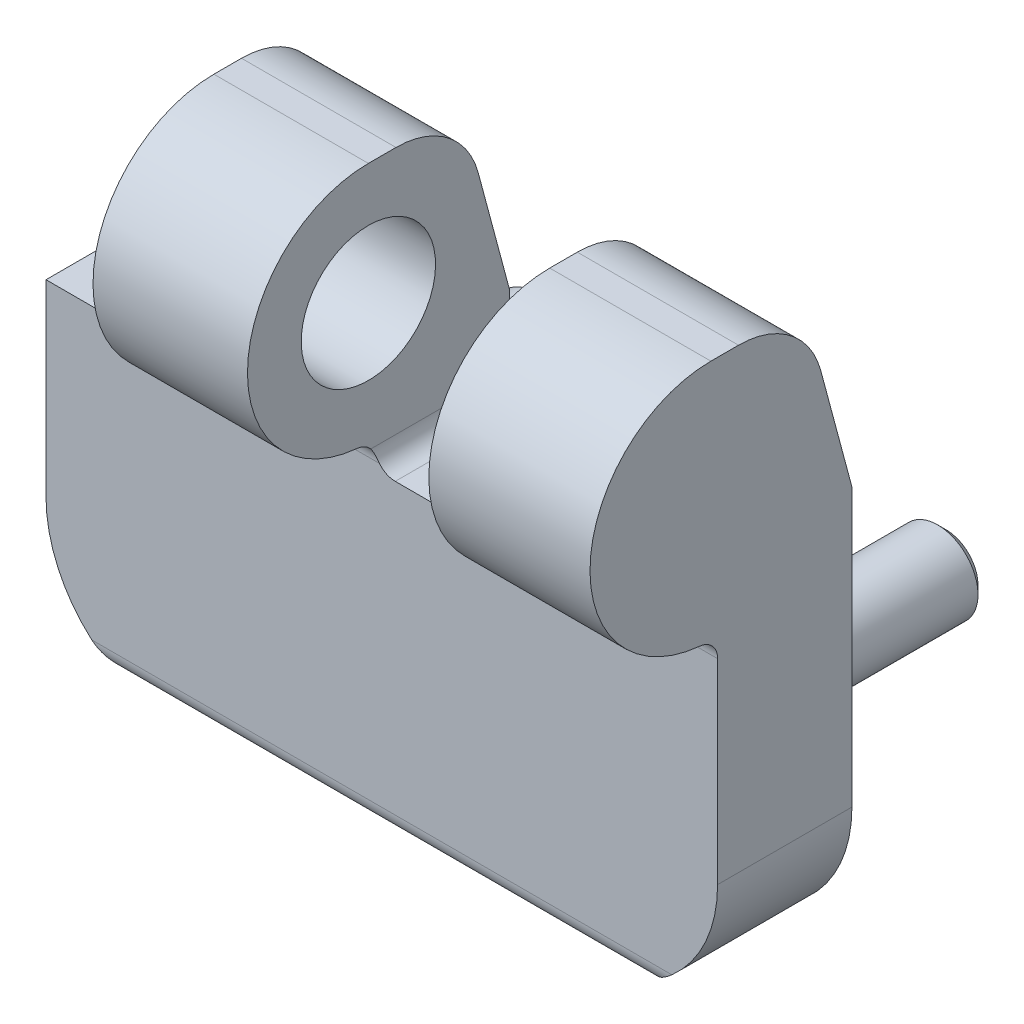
ISO-10303-21;
HEADER;
FILE_DESCRIPTION(('STEP AP214'),'2;1');
FILE_NAME('part.step','',(''),(''),'','','');
FILE_SCHEMA(('AUTOMOTIVE_DESIGN { 1 0 10303 214 1 1 1 1 }'));
ENDSEC;
DATA;
#1=APPLICATION_CONTEXT('core data for automotive mechanical design processes');
#2=APPLICATION_PROTOCOL_DEFINITION('international standard','automotive_design',2000,#1);
#3=PRODUCT_CONTEXT('',#1,'mechanical');
#4=PRODUCT('Part','Part','',(#3));
#5=PRODUCT_RELATED_PRODUCT_CATEGORY('part','',(#4));
#6=PRODUCT_DEFINITION_FORMATION('','',#4);
#7=PRODUCT_DEFINITION_CONTEXT('part definition',#1,'design');
#8=PRODUCT_DEFINITION('design','',#6,#7);
#9=PRODUCT_DEFINITION_SHAPE('','',#8);
#10=(LENGTH_UNIT() NAMED_UNIT(*) SI_UNIT(.MILLI.,.METRE.));
#11=(NAMED_UNIT(*) PLANE_ANGLE_UNIT() SI_UNIT($,.RADIAN.));
#12=(NAMED_UNIT(*) SI_UNIT($,.STERADIAN.) SOLID_ANGLE_UNIT());
#13=UNCERTAINTY_MEASURE_WITH_UNIT(LENGTH_MEASURE(1.E-05),#10,'distance_accuracy_value','');
#14=(GEOMETRIC_REPRESENTATION_CONTEXT(3) GLOBAL_UNCERTAINTY_ASSIGNED_CONTEXT((#13)) GLOBAL_UNIT_ASSIGNED_CONTEXT((#10,
#11,#12)) REPRESENTATION_CONTEXT('',''));
#15=CARTESIAN_POINT('',(0.,0.,0.));
#16=DIRECTION('',(0.,0.,1.));
#17=DIRECTION('',(1.,0.,0.));
#18=AXIS2_PLACEMENT_3D('',#15,#16,#17);
#19=CARTESIAN_POINT('',(-10.5,23.0000010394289,10.5000009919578));
#20=DIRECTION('',(1.,0.,0.));
#21=DIRECTION('',(0.,1.,0.));
#22=AXIS2_PLACEMENT_3D('',#19,#20,#21);
#23=CYLINDRICAL_SURFACE('',#22,8.99999896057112);
#24=CARTESIAN_POINT('',(40.,23.0000010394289,10.5000009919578));
#25=DIRECTION('',(1.,0.,0.));
#26=DIRECTION('',(0.,1.,0.));
#27=AXIS2_PLACEMENT_3D('',#24,#25,#26);
#28=CIRCLE('',#27,8.99999896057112);
#29=CARTESIAN_POINT('',(40.,14.0392784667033,11.3399011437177));
#30=VERTEX_POINT('',#29);
#31=CARTESIAN_POINT('',(40.,32.,10.5000009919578));
#32=VERTEX_POINT('',#31);
#33=EDGE_CURVE('E618',#30,#32,#28,.F.);
#34=ORIENTED_EDGE('',*,*,#33,.T.);
#35=DIRECTION('',(1.,0.,0.));
#36=VECTOR('',#35,1.);
#37=CARTESIAN_POINT('',(-10.5,32.,10.5));
#38=LINE('',#37,#36);
#39=CARTESIAN_POINT('',(28.,32.,10.5));
#40=VERTEX_POINT('',#39);
#41=EDGE_CURVE('E405',#40,#32,#38,.T.);
#42=ORIENTED_EDGE('',*,*,#41,.F.);
#43=CARTESIAN_POINT('',(28.,23.0000010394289,10.5000009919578));
#44=DIRECTION('',(-1.,0.,0.));
#45=DIRECTION('',(0.,-1.,0.));
#46=AXIS2_PLACEMENT_3D('',#43,#44,#45);
#47=CIRCLE('',#46,8.99999896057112);
#48=CARTESIAN_POINT('',(28.,14.0392784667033,11.3399011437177));
#49=VERTEX_POINT('',#48);
#50=EDGE_CURVE('E326',#40,#49,#47,.F.);
#51=ORIENTED_EDGE('',*,*,#50,.T.);
#52=DIRECTION('',(1.,0.,0.));
#53=VECTOR('',#52,1.);
#54=CARTESIAN_POINT('',(-10.5,14.0392784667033,11.3399011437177));
#55=LINE('',#54,#53);
#56=EDGE_CURVE('E413',#49,#30,#55,.T.);
#57=ORIENTED_EDGE('',*,*,#56,.T.);
#58=EDGE_LOOP('',(#34,#42,#51,#57));
#59=FACE_BOUND('',#58,.T.);
#60=ADVANCED_FACE('F14',(#59),#23,.T.);
#61=CARTESIAN_POINT('',(-10.5,12.5679235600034,11.4778031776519));
#62=DIRECTION('',(1.,0.,0.));
#63=DIRECTION('',(0.,1.,0.));
#64=AXIS2_PLACEMENT_3D('',#61,#62,#63);
#65=CYLINDRICAL_SURFACE('',#64,1.47780317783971);
#66=DIRECTION('',(1.,0.,0.));
#67=VECTOR('',#66,1.);
#68=CARTESIAN_POINT('',(-10.5,12.5679,10.));
#69=LINE('',#68,#67);
#70=CARTESIAN_POINT('',(27.6752402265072,12.5679,10.));
#71=VERTEX_POINT('',#70);
#72=CARTESIAN_POINT('',(40.,12.5679,10.));
#73=VERTEX_POINT('',#72);
#74=EDGE_CURVE('E652',#71,#73,#69,.T.);
#75=ORIENTED_EDGE('',*,*,#74,.T.);
#76=CARTESIAN_POINT('',(40.,12.5679235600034,11.4778031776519));
#77=DIRECTION('',(1.,0.,0.));
#78=DIRECTION('',(0.,1.,0.));
#79=AXIS2_PLACEMENT_3D('',#76,#77,#78);
#80=CIRCLE('',#79,1.47780317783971);
#81=EDGE_CURVE('E663',#73,#30,#80,.T.);
#82=ORIENTED_EDGE('',*,*,#81,.T.);
#83=ORIENTED_EDGE('',*,*,#56,.F.);
#84=CARTESIAN_POINT('',(28.,12.5679235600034,11.4778031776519));
#85=DIRECTION('',(-1.,0.,0.));
#86=DIRECTION('',(0.,-1.,0.));
#87=AXIS2_PLACEMENT_3D('',#84,#85,#86);
#88=CIRCLE('',#87,1.47780317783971);
#89=CARTESIAN_POINT('',(28.,13.5,10.3310094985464));
#90=VERTEX_POINT('',#89);
#91=EDGE_CURVE('E426',#49,#90,#88,.T.);
#92=ORIENTED_EDGE('',*,*,#91,.T.);
#93=CARTESIAN_POINT('',(27.6752402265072,12.5679,10.));
#94=CARTESIAN_POINT('',(27.6953469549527,12.5932496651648,9.9999997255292));
#95=CARTESIAN_POINT('',(27.7146256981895,12.6192459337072,10.0006524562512));
#96=CARTESIAN_POINT('',(27.7514404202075,12.6723870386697,10.0034560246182));
#97=CARTESIAN_POINT('',(27.7689754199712,12.6995325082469,10.0056076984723));
#98=CARTESIAN_POINT('',(27.8186948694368,12.7822534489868,10.0145793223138));
#99=CARTESIAN_POINT('',(27.8481248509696,12.8392792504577,10.0239134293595));
#100=CARTESIAN_POINT('',(27.8990594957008,12.9553252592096,10.0504349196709));
#101=CARTESIAN_POINT('',(27.9205285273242,13.0143531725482,10.067656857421));
#102=CARTESIAN_POINT('',(27.9553928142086,13.1317870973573,10.1103756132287));
#103=CARTESIAN_POINT('',(27.9687909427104,13.190193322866,10.1358694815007));
#104=CARTESIAN_POINT('',(27.9861412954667,13.2916068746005,10.1883468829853));
#105=CARTESIAN_POINT('',(27.9915178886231,13.3351901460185,10.2137874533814));
#106=CARTESIAN_POINT('',(27.9984562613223,13.4197494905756,10.2691385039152));
#107=CARTESIAN_POINT('',(28.0000181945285,13.4607256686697,10.2990488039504));
#108=CARTESIAN_POINT('',(28.,13.5,10.3310094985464));
#109=B_SPLINE_CURVE_WITH_KNOTS('',3,(#93,#94,#95,#96,#97,#98,#99,#100,#101,#102,#103,#104,#105,
#106,#107,#108),.UNSPECIFIED.,.F.,.F.,(4,2,2,2,2,2,2,4),(0.,0.0970229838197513,
0.194100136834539,0.387627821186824,0.58201152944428,0.776325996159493,0.9281775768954,
1.08002304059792),.UNSPECIFIED.);
#110=EDGE_CURVE('E506',#71,#90,#109,.T.);
#111=ORIENTED_EDGE('',*,*,#110,.F.);
#112=EDGE_LOOP('',(#75,#82,#83,#92,#111));
#113=FACE_BOUND('',#112,.T.);
#114=ADVANCED_FACE('F347',(#113),#65,.F.);
#115=CARTESIAN_POINT('',(-10.5,-12.,2.09368));
#116=DIRECTION('',(0.,-1.,0.));
#117=DIRECTION('',(1.,0.,0.));
#118=AXIS2_PLACEMENT_3D('',#115,#116,#117);
#119=PLANE('',#118);
#120=DIRECTION('',(1.,0.,0.));
#121=VECTOR('',#120,1.);
#122=CARTESIAN_POINT('',(-10.5,-12.,2.09368));
#123=LINE('',#122,#121);
#124=CARTESIAN_POINT('',(0.,-12.,2.09368));
#125=VERTEX_POINT('',#124);
#126=CARTESIAN_POINT('',(30.,-12.,2.09368));
#127=VERTEX_POINT('',#126);
#128=EDGE_CURVE('E309',#125,#127,#123,.T.);
#129=ORIENTED_EDGE('',*,*,#128,.F.);
#130=DIRECTION('',(0.,0.,-1.));
#131=VECTOR('',#130,1.);
#132=CARTESIAN_POINT('',(0.,-12.,19.4999999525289));
#133=LINE('',#132,#131);
#134=CARTESIAN_POINT('',(0.,-12.,0.));
#135=VERTEX_POINT('',#134);
#136=EDGE_CURVE('E231',#125,#135,#133,.T.);
#137=ORIENTED_EDGE('',*,*,#136,.T.);
#138=DIRECTION('',(1.,0.,0.));
#139=VECTOR('',#138,1.);
#140=CARTESIAN_POINT('',(-10.5,-12.,0.));
#141=LINE('',#140,#139);
#142=CARTESIAN_POINT('',(30.,-12.,0.));
#143=VERTEX_POINT('',#142);
#144=EDGE_CURVE('E422',#135,#143,#141,.T.);
#145=ORIENTED_EDGE('',*,*,#144,.T.);
#146=DIRECTION('',(0.,0.,-1.));
#147=VECTOR('',#146,1.);
#148=CARTESIAN_POINT('',(30.,-12.,19.4999999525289));
#149=LINE('',#148,#147);
#150=EDGE_CURVE('E206',#127,#143,#149,.T.);
#151=ORIENTED_EDGE('',*,*,#150,.F.);
#152=EDGE_LOOP('',(#129,#137,#145,#151));
#153=FACE_BOUND('',#152,.T.);
#154=ADVANCED_FACE('F16',(#153),#119,.T.);
#155=CARTESIAN_POINT('',(-10.5,-12.,0.));
#156=DIRECTION('',(0.,0.,-1.));
#157=DIRECTION('',(-1.,0.,0.));
#158=AXIS2_PLACEMENT_3D('',#155,#156,#157);
#159=PLANE('',#158);
#160=CARTESIAN_POINT('',(0.,0.,0.));
#161=DIRECTION('',(0.,0.,-1.));
#162=DIRECTION('',(-1.,0.,0.));
#163=AXIS2_PLACEMENT_3D('',#160,#161,#162);
#164=CIRCLE('',#163,3.);
#165=CARTESIAN_POINT('',(-3.,0.,0.));
#166=VERTEX_POINT('',#165);
#167=EDGE_CURVE('E452',#166,#166,#164,.T.);
#168=ORIENTED_EDGE('',*,*,#167,.F.);
#169=EDGE_LOOP('',(#168));
#170=FACE_BOUND('',#169,.T.);
#171=CARTESIAN_POINT('',(30.,0.,0.));
#172=DIRECTION('',(0.,0.,-1.));
#173=DIRECTION('',(-1.,0.,0.));
#174=AXIS2_PLACEMENT_3D('',#171,#172,#173);
#175=CIRCLE('',#174,3.);
#176=CARTESIAN_POINT('',(27.,0.,0.));
#177=VERTEX_POINT('',#176);
#178=EDGE_CURVE('E441',#177,#177,#175,.T.);
#179=ORIENTED_EDGE('',*,*,#178,.F.);
#180=EDGE_LOOP('',(#179));
#181=FACE_BOUND('',#180,.T.);
#182=CARTESIAN_POINT('',(0.,-2.,0.));
#183=DIRECTION('',(0.,0.,-1.));
#184=DIRECTION('',(1.,0.,0.));
#185=AXIS2_PLACEMENT_3D('',#182,#183,#184);
#186=CIRCLE('',#185,10.);
#187=CARTESIAN_POINT('',(-10.,-1.99999999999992,0.));
#188=VERTEX_POINT('',#187);
#189=EDGE_CURVE('E216',#135,#188,#186,.T.);
#190=ORIENTED_EDGE('',*,*,#189,.T.);
#191=DIRECTION('',(0.,1.,0.));
#192=VECTOR('',#191,1.);
#193=CARTESIAN_POINT('',(-10.,48.,0.));
#194=LINE('',#193,#192);
#195=CARTESIAN_POINT('',(-10.,12.,0.));
#196=VERTEX_POINT('',#195);
#197=EDGE_CURVE('E207',#188,#196,#194,.T.);
#198=ORIENTED_EDGE('',*,*,#197,.T.);
#199=DIRECTION('',(-1.,0.,0.));
#200=VECTOR('',#199,1.);
#201=CARTESIAN_POINT('',(-10.5,12.,0.));
#202=LINE('',#201,#200);
#203=CARTESIAN_POINT('',(1.5,12.,0.));
#204=VERTEX_POINT('',#203);
#205=EDGE_CURVE('E331',#204,#196,#202,.T.);
#206=ORIENTED_EDGE('',*,*,#205,.F.);
#207=CARTESIAN_POINT('',(1.5000000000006,13.4999999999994,0.));
#208=DIRECTION('',(0.,0.,-1.));
#209=DIRECTION('',(-1.,0.,0.));
#210=AXIS2_PLACEMENT_3D('',#207,#208,#209);
#211=CIRCLE('',#210,1.49999999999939);
#212=CARTESIAN_POINT('',(3.,13.5,0.));
#213=VERTEX_POINT('',#212);
#214=EDGE_CURVE('E334',#213,#204,#211,.T.);
#215=ORIENTED_EDGE('',*,*,#214,.F.);
#216=DIRECTION('',(0.,-1.,0.));
#217=VECTOR('',#216,1.);
#218=CARTESIAN_POINT('',(3.,-12.,0.));
#219=LINE('',#218,#217);
#220=CARTESIAN_POINT('',(3.,18.63888,0.));
#221=VERTEX_POINT('',#220);
#222=EDGE_CURVE('E515',#221,#213,#219,.T.);
#223=ORIENTED_EDGE('',*,*,#222,.F.);
#224=DIRECTION('',(1.,0.,0.));
#225=VECTOR('',#224,1.);
#226=CARTESIAN_POINT('',(-10.5,18.63888,0.));
#227=LINE('',#226,#225);
#228=CARTESIAN_POINT('',(14.5,18.63888,0.));
#229=VERTEX_POINT('',#228);
#230=EDGE_CURVE('E421',#221,#229,#227,.T.);
#231=ORIENTED_EDGE('',*,*,#230,.T.);
#232=DIRECTION('',(0.,1.,0.));
#233=VECTOR('',#232,1.);
#234=CARTESIAN_POINT('',(14.5,-12.,0.));
#235=LINE('',#234,#233);
#236=CARTESIAN_POINT('',(14.5,13.5,0.));
#237=VERTEX_POINT('',#236);
#238=EDGE_CURVE('E536',#237,#229,#235,.T.);
#239=ORIENTED_EDGE('',*,*,#238,.F.);
#240=CARTESIAN_POINT('',(15.9999999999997,13.4999999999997,0.));
#241=DIRECTION('',(0.,0.,-1.));
#242=DIRECTION('',(-1.,0.,0.));
#243=AXIS2_PLACEMENT_3D('',#240,#241,#242);
#244=CIRCLE('',#243,1.49999999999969);
#245=CARTESIAN_POINT('',(16.,12.,0.));
#246=VERTEX_POINT('',#245);
#247=EDGE_CURVE('E345',#246,#237,#244,.T.);
#248=ORIENTED_EDGE('',*,*,#247,.F.);
#249=DIRECTION('',(-1.,0.,0.));
#250=VECTOR('',#249,1.);
#251=CARTESIAN_POINT('',(-10.5,12.,0.));
#252=LINE('',#251,#250);
#253=CARTESIAN_POINT('',(26.5,12.,0.));
#254=VERTEX_POINT('',#253);
#255=EDGE_CURVE('E518',#254,#246,#252,.T.);
#256=ORIENTED_EDGE('',*,*,#255,.F.);
#257=CARTESIAN_POINT('',(26.5000000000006,13.4999999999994,0.));
#258=DIRECTION('',(0.,0.,-1.));
#259=DIRECTION('',(-1.,0.,0.));
#260=AXIS2_PLACEMENT_3D('',#257,#258,#259);
#261=CIRCLE('',#260,1.49999999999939);
#262=CARTESIAN_POINT('',(28.,13.5,0.));
#263=VERTEX_POINT('',#262);
#264=EDGE_CURVE('E514',#263,#254,#261,.T.);
#265=ORIENTED_EDGE('',*,*,#264,.F.);
#266=DIRECTION('',(0.,-1.,0.));
#267=VECTOR('',#266,1.);
#268=CARTESIAN_POINT('',(28.,-12.,0.));
#269=LINE('',#268,#267);
#270=CARTESIAN_POINT('',(28.,18.63888,0.));
#271=VERTEX_POINT('',#270);
#272=EDGE_CURVE('E573',#271,#263,#269,.T.);
#273=ORIENTED_EDGE('',*,*,#272,.F.);
#274=CARTESIAN_POINT('',(40.,18.63888,0.));
#275=VERTEX_POINT('',#274);
#276=EDGE_CURVE('E223',#271,#275,#227,.T.);
#277=ORIENTED_EDGE('',*,*,#276,.T.);
#278=DIRECTION('',(0.,-1.,0.));
#279=VECTOR('',#278,1.);
#280=CARTESIAN_POINT('',(40.,48.,0.));
#281=LINE('',#280,#279);
#282=CARTESIAN_POINT('',(40.,-1.99999999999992,0.));
#283=VERTEX_POINT('',#282);
#284=EDGE_CURVE('E203',#275,#283,#281,.T.);
#285=ORIENTED_EDGE('',*,*,#284,.T.);
#286=CARTESIAN_POINT('',(30.,-2.,0.));
#287=DIRECTION('',(0.,0.,-1.));
#288=DIRECTION('',(1.,0.,0.));
#289=AXIS2_PLACEMENT_3D('',#286,#287,#288);
#290=CIRCLE('',#289,10.);
#291=EDGE_CURVE('E210',#283,#143,#290,.T.);
#292=ORIENTED_EDGE('',*,*,#291,.T.);
#293=ORIENTED_EDGE('',*,*,#144,.F.);
#294=EDGE_LOOP('',(#190,#198,#206,#215,#223,#231,#239,#248,#256,#265,#273,#277,#285,#292,#293));
#295=FACE_BOUND('',#294,.T.);
#296=ADVANCED_FACE('F220',(#170,#181,#295),#159,.T.);
#297=CARTESIAN_POINT('',(-10.5,18.63888,0.));
#298=DIRECTION('',(0.,0.258817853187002,-0.965926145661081));
#299=DIRECTION('',(0.,0.965926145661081,0.258817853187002));
#300=AXIS2_PLACEMENT_3D('',#297,#298,#299);
#301=PLANE('',#300);
#302=DIRECTION('',(1.,0.,0.));
#303=VECTOR('',#302,1.);
#304=CARTESIAN_POINT('',(-10.5,27.3010467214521,2.3210091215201));
#305=LINE('',#304,#303);
#306=CARTESIAN_POINT('',(28.,27.3010467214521,2.3210091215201));
#307=VERTEX_POINT('',#306);
#308=CARTESIAN_POINT('',(40.,27.3010467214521,2.3210091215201));
#309=VERTEX_POINT('',#308);
#310=EDGE_CURVE('E416',#307,#309,#305,.T.);
#311=ORIENTED_EDGE('',*,*,#310,.T.);
#312=DIRECTION('',(0.,-0.965926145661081,-0.258817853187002));
#313=VECTOR('',#312,1.);
#314=CARTESIAN_POINT('',(40.,18.63888,0.));
#315=LINE('',#314,#313);
#316=EDGE_CURVE('E607',#309,#275,#315,.T.);
#317=ORIENTED_EDGE('',*,*,#316,.T.);
#318=ORIENTED_EDGE('',*,*,#276,.F.);
#319=DIRECTION('',(0.,-0.965926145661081,-0.258817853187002));
#320=VECTOR('',#319,1.);
#321=CARTESIAN_POINT('',(28.,18.63888,0.));
#322=LINE('',#321,#320);
#323=EDGE_CURVE('E571',#307,#271,#322,.T.);
#324=ORIENTED_EDGE('',*,*,#323,.F.);
#325=EDGE_LOOP('',(#311,#317,#318,#324));
#326=FACE_BOUND('',#325,.T.);
#327=ADVANCED_FACE('F587',(#326),#301,.T.);
#328=CARTESIAN_POINT('',(-10.5,25.6601833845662,8.44480224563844));
#329=DIRECTION('',(1.,0.,0.));
#330=DIRECTION('',(0.,1.,0.));
#331=AXIS2_PLACEMENT_3D('',#328,#329,#330);
#332=CYLINDRICAL_SURFACE('',#331,6.33981661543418);
#333=DIRECTION('',(1.,0.,0.));
#334=VECTOR('',#333,1.);
#335=CARTESIAN_POINT('',(-10.5,32.0000000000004,8.44480224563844));
#336=LINE('',#335,#334);
#337=CARTESIAN_POINT('',(28.,32.,8.44480224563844));
#338=VERTEX_POINT('',#337);
#339=CARTESIAN_POINT('',(40.,32.,8.44480224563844));
#340=VERTEX_POINT('',#339);
#341=EDGE_CURVE('E404',#338,#340,#336,.T.);
#342=ORIENTED_EDGE('',*,*,#341,.T.);
#343=CARTESIAN_POINT('',(40.,25.6601833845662,8.44480224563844));
#344=DIRECTION('',(1.,0.,0.));
#345=DIRECTION('',(0.,1.,0.));
#346=AXIS2_PLACEMENT_3D('',#343,#344,#345);
#347=CIRCLE('',#346,6.33981661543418);
#348=EDGE_CURVE('E611',#340,#309,#347,.F.);
#349=ORIENTED_EDGE('',*,*,#348,.T.);
#350=ORIENTED_EDGE('',*,*,#310,.F.);
#351=CARTESIAN_POINT('',(28.,25.6601833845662,8.44480224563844));
#352=DIRECTION('',(1.,0.,0.));
#353=DIRECTION('',(0.,1.,0.));
#354=AXIS2_PLACEMENT_3D('',#351,#352,#353);
#355=CIRCLE('',#354,6.33981661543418);
#356=EDGE_CURVE('E567',#338,#307,#355,.F.);
#357=ORIENTED_EDGE('',*,*,#356,.F.);
#358=EDGE_LOOP('',(#342,#349,#350,#357));
#359=FACE_BOUND('',#358,.T.);
#360=ADVANCED_FACE('F594',(#359),#332,.T.);
#361=CARTESIAN_POINT('',(-10.5,32.,8.4448));
#362=DIRECTION('',(0.,1.,0.));
#363=DIRECTION('',(-1.,0.,0.));
#364=AXIS2_PLACEMENT_3D('',#361,#362,#363);
#365=PLANE('',#364);
#366=ORIENTED_EDGE('',*,*,#41,.T.);
#367=DIRECTION('',(0.,0.,-1.));
#368=VECTOR('',#367,1.);
#369=CARTESIAN_POINT('',(40.,32.,8.4448));
#370=LINE('',#369,#368);
#371=EDGE_CURVE('E614',#32,#340,#370,.T.);
#372=ORIENTED_EDGE('',*,*,#371,.T.);
#373=ORIENTED_EDGE('',*,*,#341,.F.);
#374=DIRECTION('',(0.,0.,-1.));
#375=VECTOR('',#374,1.);
#376=CARTESIAN_POINT('',(28.,32.,8.4448));
#377=LINE('',#376,#375);
#378=EDGE_CURVE('E565',#40,#338,#377,.T.);
#379=ORIENTED_EDGE('',*,*,#378,.F.);
#380=EDGE_LOOP('',(#366,#372,#373,#379));
#381=FACE_BOUND('',#380,.T.);
#382=ADVANCED_FACE('F400',(#381),#365,.T.);
#383=CARTESIAN_POINT('',(-10.5,12.5679,10.));
#384=DIRECTION('',(0.,0.,1.));
#385=DIRECTION('',(1.,0.,0.));
#386=AXIS2_PLACEMENT_3D('',#383,#384,#385);
#387=PLANE('',#386);
#388=DIRECTION('',(1.,0.,0.));
#389=VECTOR('',#388,1.);
#390=CARTESIAN_POINT('',(-10.5,12.,10.));
#391=LINE('',#390,#389);
#392=CARTESIAN_POINT('',(-10.,12.,10.));
#393=VERTEX_POINT('',#392);
#394=CARTESIAN_POINT('',(1.5,12.,10.));
#395=VERTEX_POINT('',#394);
#396=EDGE_CURVE('E439',#393,#395,#391,.T.);
#397=ORIENTED_EDGE('',*,*,#396,.F.);
#398=DIRECTION('',(0.,-1.,0.));
#399=VECTOR('',#398,1.);
#400=CARTESIAN_POINT('',(-10.,12.5679,10.));
#401=LINE('',#400,#399);
#402=CARTESIAN_POINT('',(-10.,-1.99999999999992,10.));
#403=VERTEX_POINT('',#402);
#404=EDGE_CURVE('E37',#393,#403,#401,.T.);
#405=ORIENTED_EDGE('',*,*,#404,.T.);
#406=CARTESIAN_POINT('',(0.,-2.,10.));
#407=DIRECTION('',(0.,0.,1.));
#408=DIRECTION('',(1.,0.,0.));
#409=AXIS2_PLACEMENT_3D('',#406,#407,#408);
#410=CIRCLE('',#409,10.);
#411=CARTESIAN_POINT('',(-6.59414006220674,-9.5178,10.));
#412=VERTEX_POINT('',#411);
#413=EDGE_CURVE('E459',#403,#412,#410,.T.);
#414=ORIENTED_EDGE('',*,*,#413,.T.);
#415=DIRECTION('',(1.,0.,0.));
#416=VECTOR('',#415,1.);
#417=CARTESIAN_POINT('',(-10.5,-9.5178,10.));
#418=LINE('',#417,#416);
#419=CARTESIAN_POINT('',(36.5941400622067,-9.5178,10.));
#420=VERTEX_POINT('',#419);
#421=EDGE_CURVE('E678',#412,#420,#418,.T.);
#422=ORIENTED_EDGE('',*,*,#421,.T.);
#423=CARTESIAN_POINT('',(30.,-2.,10.));
#424=DIRECTION('',(0.,0.,1.));
#425=DIRECTION('',(1.,0.,0.));
#426=AXIS2_PLACEMENT_3D('',#423,#424,#425);
#427=CIRCLE('',#426,10.);
#428=CARTESIAN_POINT('',(40.,-1.99999999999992,10.));
#429=VERTEX_POINT('',#428);
#430=EDGE_CURVE('E248',#420,#429,#427,.T.);
#431=ORIENTED_EDGE('',*,*,#430,.T.);
#432=DIRECTION('',(0.,1.,0.));
#433=VECTOR('',#432,1.);
#434=CARTESIAN_POINT('',(40.,12.5679,10.));
#435=LINE('',#434,#433);
#436=EDGE_CURVE('E9',#429,#73,#435,.T.);
#437=ORIENTED_EDGE('',*,*,#436,.T.);
#438=ORIENTED_EDGE('',*,*,#74,.F.);
#439=CARTESIAN_POINT('',(26.5000000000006,13.4999999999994,10.));
#440=DIRECTION('',(0.,0.,1.));
#441=DIRECTION('',(1.,0.,0.));
#442=AXIS2_PLACEMENT_3D('',#439,#440,#441);
#443=CIRCLE('',#442,1.49999999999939);
#444=CARTESIAN_POINT('',(26.5,12.,10.));
#445=VERTEX_POINT('',#444);
#446=EDGE_CURVE('E431',#445,#71,#443,.T.);
#447=ORIENTED_EDGE('',*,*,#446,.F.);
#448=DIRECTION('',(1.,0.,0.));
#449=VECTOR('',#448,1.);
#450=CARTESIAN_POINT('',(-10.5,12.,10.));
#451=LINE('',#450,#449);
#452=CARTESIAN_POINT('',(16.,12.,10.));
#453=VERTEX_POINT('',#452);
#454=EDGE_CURVE('E433',#453,#445,#451,.T.);
#455=ORIENTED_EDGE('',*,*,#454,.F.);
#456=CARTESIAN_POINT('',(15.9999999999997,13.4999999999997,10.));
#457=DIRECTION('',(0.,0.,1.));
#458=DIRECTION('',(1.,0.,0.));
#459=AXIS2_PLACEMENT_3D('',#456,#457,#458);
#460=CIRCLE('',#459,1.49999999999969);
#461=CARTESIAN_POINT('',(14.8247597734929,12.5679,10.));
#462=VERTEX_POINT('',#461);
#463=EDGE_CURVE('E435',#462,#453,#460,.T.);
#464=ORIENTED_EDGE('',*,*,#463,.F.);
#465=CARTESIAN_POINT('',(2.67524022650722,12.5679,10.));
#466=VERTEX_POINT('',#465);
#467=EDGE_CURVE('E683',#466,#462,#69,.T.);
#468=ORIENTED_EDGE('',*,*,#467,.F.);
#469=CARTESIAN_POINT('',(1.5000000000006,13.4999999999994,10.));
#470=DIRECTION('',(0.,0.,1.));
#471=DIRECTION('',(1.,0.,0.));
#472=AXIS2_PLACEMENT_3D('',#469,#470,#471);
#473=CIRCLE('',#472,1.49999999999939);
#474=EDGE_CURVE('E437',#395,#466,#473,.T.);
#475=ORIENTED_EDGE('',*,*,#474,.F.);
#476=EDGE_LOOP('',(#397,#405,#414,#422,#431,#437,#438,#447,#455,#464,#468,#475));
#477=FACE_BOUND('',#476,.T.);
#478=ADVANCED_FACE('F647',(#477),#387,.T.);
#479=CARTESIAN_POINT('',(-10.5,-9.51774307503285,8.52207909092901));
#480=DIRECTION('',(1.,0.,0.));
#481=DIRECTION('',(0.,1.,0.));
#482=AXIS2_PLACEMENT_3D('',#479,#480,#481);
#483=CYLINDRICAL_SURFACE('',#482,1.47792091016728);
#484=ORIENTED_EDGE('',*,*,#421,.F.);
#485=CARTESIAN_POINT('',(-6.59414006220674,-9.5178,10.));
#486=CARTESIAN_POINT('',(-6.51978904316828,-9.58303198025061,9.99996115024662));
#487=CARTESIAN_POINT('',(-6.44449688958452,-9.64710619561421,9.99567804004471));
#488=CARTESIAN_POINT('',(-6.29259700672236,-9.77257081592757,9.97924765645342));
#489=CARTESIAN_POINT('',(-6.21598991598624,-9.83396247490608,9.96710410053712));
#490=CARTESIAN_POINT('',(-6.06145194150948,-9.95414767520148,9.93547288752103));
#491=CARTESIAN_POINT('',(-5.98351567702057,-10.0129216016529,9.9159377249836));
#492=CARTESIAN_POINT('',(-5.82731873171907,-10.1272206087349,9.86988707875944));
#493=CARTESIAN_POINT('',(-5.74905804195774,-10.1827455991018,9.84337140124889));
#494=CARTESIAN_POINT('',(-5.60334783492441,-10.2830687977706,9.78752824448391));
#495=CARTESIAN_POINT('',(-5.53586587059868,-10.3283028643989,9.7590643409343));
#496=CARTESIAN_POINT('',(-5.40154580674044,-10.4160402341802,9.69689996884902));
#497=CARTESIAN_POINT('',(-5.33470761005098,-10.4585439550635,9.66320030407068));
#498=CARTESIAN_POINT('',(-5.20229768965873,-10.5406183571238,9.59025115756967));
#499=CARTESIAN_POINT('',(-5.13672547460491,-10.5801901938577,9.55100388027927));
#500=CARTESIAN_POINT('',(-5.00776152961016,-10.6560908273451,9.46635038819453));
#501=CARTESIAN_POINT('',(-4.94436794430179,-10.692422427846,9.42094958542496));
#502=CARTESIAN_POINT('',(-4.8266756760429,-10.7582722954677,9.32726159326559));
#503=CARTESIAN_POINT('',(-4.77206981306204,-10.7881091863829,9.27959154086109));
#504=CARTESIAN_POINT('',(-4.66814858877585,-10.8437448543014,9.17732093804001));
#505=CARTESIAN_POINT('',(-4.61879852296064,-10.8695707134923,9.12277181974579));
#506=CARTESIAN_POINT('',(-4.54116493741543,-10.9094977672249,9.0214209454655));
#507=CARTESIAN_POINT('',(-4.51085338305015,-10.9248564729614,8.97673196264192));
#508=CARTESIAN_POINT('',(-4.45665801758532,-10.9520487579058,8.88188201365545));
#509=CARTESIAN_POINT('',(-4.43286325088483,-10.9638337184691,8.83165724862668));
#510=CARTESIAN_POINT('',(-4.41380454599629,-10.973200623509,8.7787764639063));
#511=B_SPLINE_CURVE_WITH_KNOTS('',3,(#485,#486,#487,#488,#489,#490,#491,#492,#493,#494,#495,
#496,#497,#498,#499,#500,#501,#502,#503,#504,#505,#506,#507,#508,#509,#510),.UNSPECIFIED.,.F.,
.F.,(4,2,2,2,2,2,2,2,2,2,2,2,4),(0.,0.296550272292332,0.592960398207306,0.891308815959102,
1.18966551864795,1.44772210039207,1.70573910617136,1.96365387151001,2.22134325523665,
2.45608351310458,2.68916259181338,2.85692452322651,3.02687575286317),.UNSPECIFIED.);
#512=CARTESIAN_POINT('',(-4.41380454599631,-10.973200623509,8.7787764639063));
#513=VERTEX_POINT('',#512);
#514=EDGE_CURVE('E665',#412,#513,#511,.T.);
#515=ORIENTED_EDGE('',*,*,#514,.T.);
#516=DIRECTION('',(1.,0.,0.));
#517=VECTOR('',#516,1.);
#518=CARTESIAN_POINT('',(-10.5,-10.973200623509,8.7787764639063));
#519=LINE('',#518,#517);
#520=CARTESIAN_POINT('',(34.4138045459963,-10.973200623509,8.7787764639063));
#521=VERTEX_POINT('',#520);
#522=EDGE_CURVE('E313',#513,#521,#519,.T.);
#523=ORIENTED_EDGE('',*,*,#522,.T.);
#524=CARTESIAN_POINT('',(34.4138045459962,-10.973200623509,8.7787764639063));
#525=CARTESIAN_POINT('',(34.4243618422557,-10.968007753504,8.80821601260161));
#526=CARTESIAN_POINT('',(34.4364655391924,-10.962030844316,8.83689075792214));
#527=CARTESIAN_POINT('',(34.4631940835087,-10.9487496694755,8.89260179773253));
#528=CARTESIAN_POINT('',(34.4778102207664,-10.9414499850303,8.91964333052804));
#529=CARTESIAN_POINT('',(34.5242226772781,-10.9181043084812,8.9976431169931));
#530=CARTESIAN_POINT('',(34.5589383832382,-10.9004393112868,9.04637492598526));
#531=CARTESIAN_POINT('',(34.6267309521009,-10.8653572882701,9.13025081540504));
#532=CARTESIAN_POINT('',(34.6590209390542,-10.8484437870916,9.16627683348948));
#533=CARTESIAN_POINT('',(34.7259843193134,-10.8128607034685,9.23511342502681));
#534=CARTESIAN_POINT('',(34.7606586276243,-10.7941904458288,9.26792275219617));
#535=CARTESIAN_POINT('',(34.8679028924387,-10.7355690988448,9.36275497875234));
#536=CARTESIAN_POINT('',(34.943054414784,-10.693334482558,9.42044452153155));
#537=CARTESIAN_POINT('',(35.091142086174,-10.6073862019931,9.52259301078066));
#538=CARTESIAN_POINT('',(35.1638332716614,-10.5640109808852,9.56771372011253));
#539=CARTESIAN_POINT('',(35.3109614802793,-10.4735555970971,9.65099609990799));
#540=CARTESIAN_POINT('',(35.3853997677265,-10.4264726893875,9.68915254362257));
#541=CARTESIAN_POINT('',(35.5348178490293,-10.3290889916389,9.75882366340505));
#542=CARTESIAN_POINT('',(35.6097947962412,-10.2788001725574,9.79036135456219));
#543=CARTESIAN_POINT('',(35.7599441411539,-10.1750454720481,9.84710691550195));
#544=CARTESIAN_POINT('',(35.8351165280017,-10.1215797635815,9.87231512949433));
#545=CARTESIAN_POINT('',(35.9680880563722,-10.0241567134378,9.91128225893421));
#546=CARTESIAN_POINT('',(36.0259511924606,-9.98080144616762,9.92634120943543));
#547=CARTESIAN_POINT('',(36.1412754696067,-9.89240224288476,9.95246513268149));
#548=CARTESIAN_POINT('',(36.1987366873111,-9.84735863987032,9.96353088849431));
#549=CARTESIAN_POINT('',(36.3130105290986,-9.75572379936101,9.98146084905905));
#550=CARTESIAN_POINT('',(36.3698236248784,-9.70913379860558,9.98832832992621));
#551=CARTESIAN_POINT('',(36.482647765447,-9.61450738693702,9.99759251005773));
#552=CARTESIAN_POINT('',(36.5386584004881,-9.56647027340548,9.99998700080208));
#553=CARTESIAN_POINT('',(36.5941400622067,-9.5178,10.));
#554=B_SPLINE_CURVE_WITH_KNOTS('',3,(#524,#525,#526,#527,#528,#529,#530,#531,#532,#533,#534,
#535,#536,#537,#538,#539,#540,#541,#542,#543,#544,#545,#546,#547,#548,#549,#550,#551,#552,#553),
.UNSPECIFIED.,.F.,.F.,(4,2,2,2,2,2,2,2,2,2,2,2,2,2,4),(0.,0.0949528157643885,0.18958285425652,
0.375945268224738,0.529508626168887,0.683131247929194,0.993434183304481,1.28086650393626,
1.56851366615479,1.85514339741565,2.14175753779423,2.3632048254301,2.584608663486,
2.80583950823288,3.02717955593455),.UNSPECIFIED.);
#555=EDGE_CURVE('E239',#521,#420,#554,.T.);
#556=ORIENTED_EDGE('',*,*,#555,.T.);
#557=EDGE_LOOP('',(#484,#515,#523,#556));
#558=FACE_BOUND('',#557,.T.);
#559=ADVANCED_FACE('F250',(#558),#483,.T.);
#560=CARTESIAN_POINT('',(-10.5,-10.973200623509,8.7787764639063));
#561=DIRECTION('',(0.,-0.984807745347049,0.1736482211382));
#562=DIRECTION('',(0.,-0.1736482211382,-0.984807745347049));
#563=AXIS2_PLACEMENT_3D('',#560,#561,#562);
#564=PLANE('',#563);
#565=ORIENTED_EDGE('',*,*,#522,.F.);
#566=CARTESIAN_POINT('',(0.,-2.,59.6683128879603));
#567=DIRECTION('',(0.,-0.984807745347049,0.1736482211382));
#568=DIRECTION('',(0.,-0.1736482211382,-0.984807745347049));
#569=AXIS2_PLACEMENT_3D('',#566,#567,#568);
#570=ELLIPSE('',#569,57.5876904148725,10.);
#571=CARTESIAN_POINT('',(-1.72382314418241,-11.850301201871,3.80449318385));
#572=VERTEX_POINT('',#571);
#573=EDGE_CURVE('E673',#513,#572,#570,.T.);
#574=ORIENTED_EDGE('',*,*,#573,.T.);
#575=DIRECTION('',(1.,0.,0.));
#576=VECTOR('',#575,1.);
#577=CARTESIAN_POINT('',(-10.5,-11.850301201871,3.80449318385));
#578=LINE('',#577,#576);
#579=CARTESIAN_POINT('',(31.7238231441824,-11.850301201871,3.80449318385));
#580=VERTEX_POINT('',#579);
#581=EDGE_CURVE('E308',#572,#580,#578,.T.);
#582=ORIENTED_EDGE('',*,*,#581,.T.);
#583=CARTESIAN_POINT('',(30.,-2.,59.6683128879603));
#584=DIRECTION('',(0.,-0.984807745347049,0.1736482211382));
#585=DIRECTION('',(0.,-0.1736482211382,-0.984807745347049));
#586=AXIS2_PLACEMENT_3D('',#583,#584,#585);
#587=ELLIPSE('',#586,57.5876904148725,10.);
#588=EDGE_CURVE('E236',#580,#521,#587,.T.);
#589=ORIENTED_EDGE('',*,*,#588,.T.);
#590=EDGE_LOOP('',(#565,#574,#582,#589));
#591=FACE_BOUND('',#590,.T.);
#592=ADVANCED_FACE('F288',(#591),#564,.T.);
#593=CARTESIAN_POINT('',(-10.5,-2.1559199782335,2.09426381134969));
#594=DIRECTION('',(1.,0.,0.));
#595=DIRECTION('',(0.,1.,0.));
#596=AXIS2_PLACEMENT_3D('',#593,#594,#595);
#597=CYLINDRICAL_SURFACE('',#596,9.8440800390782);
#598=CARTESIAN_POINT('',(30.,-12.0000000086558,2.09426381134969));
#599=CARTESIAN_POINT('',(30.0047304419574,-12.0000000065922,2.08956627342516));
#600=CARTESIAN_POINT('',(30.0094609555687,-11.999996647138,2.08486875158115));
#601=CARTESIAN_POINT('',(30.3968595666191,-11.9994465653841,1.70017899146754));
#602=CARTESIAN_POINT('',(30.7799736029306,-11.9769319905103,1.32030617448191));
#603=CARTESIAN_POINT('',(31.5437013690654,-11.887622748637,0.562794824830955));
#604=CARTESIAN_POINT('',(31.9243128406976,-11.8207924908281,0.185158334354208));
#605=CARTESIAN_POINT('',(32.6811112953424,-11.6417373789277,-0.565517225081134));
#606=CARTESIAN_POINT('',(33.0572870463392,-11.529415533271,-0.938544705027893));
#607=CARTESIAN_POINT('',(33.8009862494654,-11.2579229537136,-1.67583891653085));
#608=CARTESIAN_POINT('',(34.1685144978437,-11.0987788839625,-2.04011050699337));
#609=CARTESIAN_POINT('',(34.7820892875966,-10.7870165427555,-2.64798820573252));
#610=CARTESIAN_POINT('',(35.0313284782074,-10.6469195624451,-2.89483719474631));
#611=CARTESIAN_POINT('',(35.5221941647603,-10.3419932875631,-3.38080676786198));
#612=CARTESIAN_POINT('',(35.7638207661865,-10.1771643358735,-3.61992745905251));
#613=CARTESIAN_POINT('',(36.2370542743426,-9.82217935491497,-4.08800969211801));
#614=CARTESIAN_POINT('',(36.4686792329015,-9.63207171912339,-4.3169895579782));
#615=CARTESIAN_POINT('',(36.920006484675,-9.22535385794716,-4.76285070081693));
#616=CARTESIAN_POINT('',(37.139712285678,-9.00875149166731,-4.97973553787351));
#617=CARTESIAN_POINT('',(37.5094178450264,-8.60776579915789,-5.34434111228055));
#618=CARTESIAN_POINT('',(37.6627562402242,-8.42952614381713,-5.49544887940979));
#619=CARTESIAN_POINT('',(37.9599047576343,-8.05776593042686,-5.787998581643));
#620=CARTESIAN_POINT('',(38.1037153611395,-7.86424614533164,-5.92944100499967));
#621=CARTESIAN_POINT('',(38.3800755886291,-7.46203461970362,-6.20090820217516));
#622=CARTESIAN_POINT('',(38.5126344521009,-7.25335559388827,-6.3309423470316));
#623=CARTESIAN_POINT('',(38.7647699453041,-6.82093332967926,-6.5778467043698));
#624=CARTESIAN_POINT('',(38.8843508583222,-6.59719510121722,-6.69472126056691));
#625=CARTESIAN_POINT('',(39.0858619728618,-6.18199288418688,-6.89118023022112));
#626=CARTESIAN_POINT('',(39.1705156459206,-5.99315302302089,-6.97352588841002));
#627=CARTESIAN_POINT('',(39.3291877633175,-5.60691104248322,-7.12743627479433));
#628=CARTESIAN_POINT('',(39.4032121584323,-5.40951379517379,-7.19900703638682));
#629=CARTESIAN_POINT('',(39.5395761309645,-5.0069316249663,-7.33030280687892));
#630=CARTESIAN_POINT('',(39.601918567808,-4.80174862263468,-7.39003071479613));
#631=CARTESIAN_POINT('',(39.7139094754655,-4.38465543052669,-7.49661589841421));
#632=CARTESIAN_POINT('',(39.7635578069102,-4.17274516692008,-7.54347303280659));
#633=CARTESIAN_POINT('',(39.8495404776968,-3.74214663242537,-7.62366174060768));
#634=CARTESIAN_POINT('',(39.8857814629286,-3.52342192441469,-7.65689864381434));
#635=CARTESIAN_POINT('',(39.943744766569,-3.0823197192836,-7.7086439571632));
#636=CARTESIAN_POINT('',(39.9654670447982,-2.85994221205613,-7.72715232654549));
#637=CARTESIAN_POINT('',(39.99394669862,-2.41355809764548,-7.74898014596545));
#638=CARTESIAN_POINT('',(40.0007090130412,-2.18955205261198,-7.75230460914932));
#639=CARTESIAN_POINT('',(39.9991735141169,-1.74189941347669,-7.74365282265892));
#640=CARTESIAN_POINT('',(39.9908769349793,-1.51825279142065,-7.73167782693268));
#641=CARTESIAN_POINT('',(39.9611677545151,-1.0973749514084,-7.69476553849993));
#642=CARTESIAN_POINT('',(39.9412673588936,-0.899897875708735,-7.6713667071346));
#643=CARTESIAN_POINT('',(39.8900603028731,-0.508106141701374,-7.6129427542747));
#644=CARTESIAN_POINT('',(39.8587499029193,-0.313792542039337,-7.57791382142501));
#645=CARTESIAN_POINT('',(39.7852891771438,0.0703506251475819,-7.49678218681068));
#646=CARTESIAN_POINT('',(39.7431417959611,0.260181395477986,-7.45068249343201));
#647=CARTESIAN_POINT('',(39.6486697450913,0.6344733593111,-7.34805035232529));
#648=CARTESIAN_POINT('',(39.5963412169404,0.818932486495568,-7.29151394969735));
#649=CARTESIAN_POINT('',(39.4797563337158,1.18960908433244,-7.16604367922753));
#650=CARTESIAN_POINT('',(39.4150755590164,1.37554501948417,-7.09667286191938));
#651=CARTESIAN_POINT('',(39.2763631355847,1.73993947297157,-6.94824402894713));
#652=CARTESIAN_POINT('',(39.2023278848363,1.91839507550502,-6.86918228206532));
#653=CARTESIAN_POINT('',(38.9675689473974,2.44169975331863,-6.61878247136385));
#654=CARTESIAN_POINT('',(38.7941290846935,2.774682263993,-6.43416226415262));
#655=CARTESIAN_POINT('',(38.4632591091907,3.33419630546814,-6.08178224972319));
#656=CARTESIAN_POINT('',(38.3111928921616,3.56769032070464,-5.91977345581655));
#657=CARTESIAN_POINT('',(37.9939123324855,4.01434506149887,-5.58116598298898));
#658=CARTESIAN_POINT('',(37.8286961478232,4.22750292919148,-5.40456525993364));
#659=CARTESIAN_POINT('',(37.487122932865,4.63428881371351,-5.03834847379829));
#660=CARTESIAN_POINT('',(37.3107314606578,4.82785115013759,-4.84869200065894));
#661=CARTESIAN_POINT('',(36.9495762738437,5.1951165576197,-4.45859219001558));
#662=CARTESIAN_POINT('',(36.7648136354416,5.36882217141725,-4.25815023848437));
#663=CARTESIAN_POINT('',(36.3279319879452,5.7502575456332,-3.78106402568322));
#664=CARTESIAN_POINT('',(36.073416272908,5.95072958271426,-3.50080371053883));
#665=CARTESIAN_POINT('',(35.5577973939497,6.31933091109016,-2.92500920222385));
#666=CARTESIAN_POINT('',(35.2966888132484,6.48743255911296,-2.62946222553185));
#667=CARTESIAN_POINT('',(34.9049079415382,6.71577363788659,-2.17510932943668));
#668=CARTESIAN_POINT('',(34.7744265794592,6.78785789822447,-2.02197993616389));
#669=CARTESIAN_POINT('',(34.5142994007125,6.92427268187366,-1.71162178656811));
#670=CARTESIAN_POINT('',(34.3846534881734,6.9886041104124,-1.55439351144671));
#671=CARTESIAN_POINT('',(34.1276387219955,7.1094864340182,-1.23548170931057));
#672=CARTESIAN_POINT('',(34.0002674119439,7.16604622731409,-1.07380353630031));
#673=CARTESIAN_POINT('',(33.7495609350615,7.27141999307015,-0.744928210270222));
#674=CARTESIAN_POINT('',(33.6262243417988,7.32023672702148,-0.577733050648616));
#675=CARTESIAN_POINT('',(33.438139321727,7.39066250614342,-0.309646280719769));
#676=CARTESIAN_POINT('',(33.3709915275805,7.41494818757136,-0.21113993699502));
#677=CARTESIAN_POINT('',(33.2398767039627,7.4608675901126,-0.0113997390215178));
#678=CARTESIAN_POINT('',(33.1759099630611,7.48250107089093,0.0898343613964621));
#679=CARTESIAN_POINT('',(33.052389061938,7.52297948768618,0.295434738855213));
#680=CARTESIAN_POINT('',(32.9928318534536,7.5418263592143,0.399798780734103));
#681=CARTESIAN_POINT('',(32.879782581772,7.57655222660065,0.61221271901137));
#682=CARTESIAN_POINT('',(32.8262884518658,7.59243223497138,0.720261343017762));
#683=CARTESIAN_POINT('',(32.7101334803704,7.62600541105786,0.979602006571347));
#684=CARTESIAN_POINT('',(32.6509167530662,7.64235519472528,1.13267882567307));
#685=CARTESIAN_POINT('',(32.5556157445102,7.66805699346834,1.4462311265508));
#686=CARTESIAN_POINT('',(32.5194500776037,7.67743364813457,1.60667840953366));
#687=CARTESIAN_POINT('',(32.4776338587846,7.68823585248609,1.93433916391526));
#688=CARTESIAN_POINT('',(32.4724072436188,7.68955094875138,2.10161514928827));
#689=CARTESIAN_POINT('',(32.4951484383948,7.68371388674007,2.43375097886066));
#690=CARTESIAN_POINT('',(32.5231624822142,7.67654993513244,2.59860713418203));
#691=CARTESIAN_POINT('',(32.6171569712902,7.65159464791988,2.96720318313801));
#692=CARTESIAN_POINT('',(32.6917523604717,7.6313355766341,3.16845692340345));
#693=CARTESIAN_POINT('',(32.8229418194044,7.59339037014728,3.46049727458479));
#694=CARTESIAN_POINT('',(32.870057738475,7.57942936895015,3.55647604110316));
#695=CARTESIAN_POINT('',(32.9692220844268,7.54915686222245,3.74548648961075));
#696=CARTESIAN_POINT('',(33.0212696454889,7.53284576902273,3.83851868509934));
#697=CARTESIAN_POINT('',(33.1591703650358,7.48827803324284,4.0733023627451));
#698=CARTESIAN_POINT('',(33.2476475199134,7.45844317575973,4.21319568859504));
#699=CARTESIAN_POINT('',(33.4303469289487,7.39372885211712,4.48801316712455));
#700=CARTESIAN_POINT('',(33.5245720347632,7.35884687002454,4.62293479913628));
#701=CARTESIAN_POINT('',(33.7168857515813,7.28414884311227,4.88892373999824));
#702=CARTESIAN_POINT('',(33.8149803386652,7.24432494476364,5.01998449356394));
#703=CARTESIAN_POINT('',(34.0135594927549,7.15985838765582,5.27870839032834));
#704=CARTESIAN_POINT('',(34.1140444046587,7.11521503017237,5.40637103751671));
#705=CARTESIAN_POINT('',(34.4180936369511,6.97387233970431,5.78558005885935));
#706=CARTESIAN_POINT('',(34.6238043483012,6.86993095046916,6.0327459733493));
#707=CARTESIAN_POINT('',(35.03575010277,6.64272183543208,6.51706779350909));
#708=CARTESIAN_POINT('',(35.2419845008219,6.51947173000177,6.7542325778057));
#709=CARTESIAN_POINT('',(35.6687953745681,6.24224885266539,7.23825616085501));
#710=CARTESIAN_POINT('',(35.8891723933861,6.08659168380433,7.48433200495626));
#711=CARTESIAN_POINT('',(36.324065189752,5.75123732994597,7.96527191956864));
#712=CARTESIAN_POINT('',(36.5385787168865,5.57153106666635,8.20013171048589));
#713=CARTESIAN_POINT('',(36.9581936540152,5.18777570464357,8.65663116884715));
#714=CARTESIAN_POINT('',(37.1633186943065,4.98379297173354,8.87830450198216));
#715=CARTESIAN_POINT('',(37.5615532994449,4.55053910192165,9.30690727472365));
#716=CARTESIAN_POINT('',(37.7546683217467,4.32127958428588,9.51384341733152));
#717=CARTESIAN_POINT('',(38.2037654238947,3.73461629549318,9.99394883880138));
#718=CARTESIAN_POINT('',(38.4520940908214,3.36382818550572,10.2584410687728));
#719=CARTESIAN_POINT('',(38.7925174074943,2.76905762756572,10.6209560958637));
#720=CARTESIAN_POINT('',(38.9006440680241,2.56437626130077,10.7360875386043));
#721=CARTESIAN_POINT('',(39.1046825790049,2.14241490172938,10.9535240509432));
#722=CARTESIAN_POINT('',(39.2005963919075,1.9251369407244,11.0558311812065));
#723=CARTESIAN_POINT('',(39.3637581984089,1.51571682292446,11.2302372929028));
#724=CARTESIAN_POINT('',(39.4331242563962,1.3253510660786,11.3045346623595));
#725=CARTESIAN_POINT('',(39.5611092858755,0.937163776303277,11.4420506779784));
#726=CARTESIAN_POINT('',(39.6197304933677,0.739343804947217,11.505271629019));
#727=CARTESIAN_POINT('',(39.7252404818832,0.337278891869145,11.6196790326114));
#728=CARTESIAN_POINT('',(39.7721343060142,0.133036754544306,11.6708706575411));
#729=CARTESIAN_POINT('',(39.8533502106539,-0.280718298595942,11.7604070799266));
#730=CARTESIAN_POINT('',(39.8876721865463,-0.490231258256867,11.7987517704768));
#731=CARTESIAN_POINT('',(39.9431801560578,-0.914138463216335,11.862070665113));
#732=CARTESIAN_POINT('',(39.9642966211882,-1.12855248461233,11.8869740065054));
#733=CARTESIAN_POINT('',(39.9926251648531,-1.55947463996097,11.9226361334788));
#734=CARTESIAN_POINT('',(39.9998372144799,-1.77598277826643,11.9333948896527));
#735=CARTESIAN_POINT('',(40.0001573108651,-2.20921898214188,11.9405830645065));
#736=CARTESIAN_POINT('',(39.9932671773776,-2.42594701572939,11.9370143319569));
#737=CARTESIAN_POINT('',(39.9654908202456,-2.85778940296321,11.9156701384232));
#738=CARTESIAN_POINT('',(39.9446052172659,-3.07290382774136,11.897895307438));
#739=CARTESIAN_POINT('',(39.8915644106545,-3.48183635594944,11.8506263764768));
#740=CARTESIAN_POINT('',(39.8605016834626,-3.6759270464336,11.8222405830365));
#741=CARTESIAN_POINT('',(39.7874448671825,-4.0601399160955,11.7543843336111));
#742=CARTESIAN_POINT('',(39.7454466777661,-4.25026057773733,11.7149097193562));
#743=CARTESIAN_POINT('',(39.6511483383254,-4.62540366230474,11.6255148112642));
#744=CARTESIAN_POINT('',(39.5988484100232,-4.81042619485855,11.575594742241));
#745=CARTESIAN_POINT('',(39.4846539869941,-5.1745496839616,11.4660274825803));
#746=CARTESIAN_POINT('',(39.4227575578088,-5.35364943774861,11.4063783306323));
#747=CARTESIAN_POINT('',(39.2690429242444,-5.76113439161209,11.2577312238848));
#748=CARTESIAN_POINT('',(39.1739667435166,-5.98709523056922,11.1654304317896));
#749=CARTESIAN_POINT('',(38.9702236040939,-6.42648644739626,10.9670496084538));
#750=CARTESIAN_POINT('',(38.8615531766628,-6.63991360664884,10.8609660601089));
#751=CARTESIAN_POINT('',(38.6322137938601,-7.05380174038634,10.6366361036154));
#752=CARTESIAN_POINT('',(38.5115334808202,-7.25425013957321,10.5183781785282));
#753=CARTESIAN_POINT('',(38.2597999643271,-7.64172959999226,10.2713431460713));
#754=CARTESIAN_POINT('',(38.1287438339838,-7.82875684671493,10.1425630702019));
#755=CARTESIAN_POINT('',(37.8091120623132,-8.25392802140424,9.82814772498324));
#756=CARTESIAN_POINT('',(37.6167452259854,-8.48639218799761,9.63866726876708));
#757=CARTESIAN_POINT('',(37.2185096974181,-8.92685541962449,9.24600831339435));
#758=CARTESIAN_POINT('',(37.0126373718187,-9.13484785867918,9.04282612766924));
#759=CARTESIAN_POINT('',(36.5891382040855,-9.52774748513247,8.62455412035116));
#760=CARTESIAN_POINT('',(36.371471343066,-9.71256798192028,8.40942368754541));
#761=CARTESIAN_POINT('',(35.927221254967,-10.0589937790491,7.97011082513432));
#762=CARTESIAN_POINT('',(35.700639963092,-10.2206040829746,7.74593035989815));
#763=CARTESIAN_POINT('',(35.1732778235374,-10.5652324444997,7.22394177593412));
#764=CARTESIAN_POINT('',(34.870069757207,-10.7408229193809,6.92366987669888));
#765=CARTESIAN_POINT('',(34.2544663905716,-11.0564476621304,6.31380040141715));
#766=CARTESIAN_POINT('',(33.9420661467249,-11.1964623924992,6.00419780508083));
#767=CARTESIAN_POINT('',(33.3142071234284,-11.440772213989,5.38179975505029));
#768=CARTESIAN_POINT('',(32.9988237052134,-11.5454559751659,5.06908082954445));
#769=CARTESIAN_POINT('',(32.5226417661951,-11.6779842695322,4.59684042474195));
#770=CARTESIAN_POINT('',(32.3634866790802,-11.7180618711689,4.43898926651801));
#771=CARTESIAN_POINT('',(32.0442815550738,-11.7901820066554,4.1223776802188));
#772=CARTESIAN_POINT('',(31.8842315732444,-11.8222250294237,3.96361730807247));
#773=CARTESIAN_POINT('',(31.7238231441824,-11.850301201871,3.80449318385));
#774=B_SPLINE_CURVE_WITH_KNOTS('',3,(#598,#599,#600,#601,#602,#603,#604,#605,#606,#607,#608,
#609,#610,#611,#612,#613,#614,#615,#616,#617,#618,#619,#620,#621,#622,#623,#624,#625,#626,#627,
#628,#629,#630,#631,#632,#633,#634,#635,#636,#637,#638,#639,#640,#641,#642,#643,#644,#645,#646,
#647,#648,#649,#650,#651,#652,#653,#654,#655,#656,#657,#658,#659,#660,#661,#662,#663,#664,#665,
#666,#667,#668,#669,#670,#671,#672,#673,#674,#675,#676,#677,#678,#679,#680,#681,#682,#683,#684,
#685,#686,#687,#688,#689,#690,#691,#692,#693,#694,#695,#696,#697,#698,#699,#700,#701,#702,#703,
#704,#705,#706,#707,#708,#709,#710,#711,#712,#713,#714,#715,#716,#717,#718,#719,#720,#721,#722,
#723,#724,#725,#726,#727,#728,#729,#730,#731,#732,#733,#734,#735,#736,#737,#738,#739,#740,#741,
#742,#743,#744,#745,#746,#747,#748,#749,#750,#751,#752,#753,#754,#755,#756,#757,#758,#759,#760,
#761,#762,#763,#764,#765,#766,#767,#768,#769,#770,#771,#772,#773),.UNSPECIFIED.,.F.,.F.,(4,2,2,
2,2,2,2,2,2,2,2,2,2,2,2,2,2,2,2,2,2,2,2,2,2,2,2,2,2,2,2,2,2,2,2,2,2,2,2,2,2,2,2,2,2,2,2,2,2,2,2,
2,2,2,2,2,2,2,2,2,2,2,2,2,2,2,2,2,2,2,2,2,2,2,2,2,2,2,2,2,2,2,2,2,2,2,2,4),(0.,
0.0200000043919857,1.63784800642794,3.25699691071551,4.87961629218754,6.50131341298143,
7.63366531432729,8.76600151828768,9.89620037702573,11.0260647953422,11.8638814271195,
12.7016557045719,13.5387352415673,14.3755376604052,15.0431030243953,15.7102931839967,
16.3773198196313,17.0443537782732,17.7159485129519,18.3875451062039,19.0589199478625,
19.7302397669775,20.3291064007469,20.9281694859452,21.5270699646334,22.1261978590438,
22.7517613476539,23.3775664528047,24.6285336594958,25.5943195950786,26.5602410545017,
27.5292997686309,28.4982342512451,29.7816779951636,31.0662129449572,31.7071861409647,
32.3480844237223,32.9882426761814,33.6281721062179,33.9930855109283,34.3580319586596,
34.7227237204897,35.0872907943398,35.5807297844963,36.0724168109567,36.5708257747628,
37.0699287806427,37.7128698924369,38.0362798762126,38.3596331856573,38.8638663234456,
39.3683516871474,39.8736492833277,40.3790202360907,41.3920647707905,42.4041901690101,
43.498723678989,44.5936715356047,45.6856920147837,46.7772125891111,48.3270848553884,
49.1019733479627,49.8767371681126,50.5235250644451,51.1701782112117,51.8165527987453,
52.462932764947,53.1126879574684,53.7624445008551,54.4121172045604,55.0617610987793,
55.6569025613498,56.2522674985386,56.8476196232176,57.443091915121,58.2277939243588,
59.0126965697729,59.7983486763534,60.5842232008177,61.6515297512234,62.719124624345,
63.7906013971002,64.8618468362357,66.2444102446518,67.6277312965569,68.9952968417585,
69.6783147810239,70.36129114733),.UNSPECIFIED.);
#775=CARTESIAN_POINT('',(30.0005879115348,-11.999999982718,2.09368000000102));
#776=VERTEX_POINT('',#775);
#777=CARTESIAN_POINT('',(30.,-12.0000000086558,2.09426381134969));
#778=VERTEX_POINT('',#777);
#779=EDGE_CURVE('E265',#776,#778,#774,.F.);
#780=ORIENTED_EDGE('',*,*,#779,.T.);
#781=CARTESIAN_POINT('',(31.7238231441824,-11.850301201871,3.80449318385));
#782=CARTESIAN_POINT('',(31.4402103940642,-11.8999310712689,3.52290507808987));
#783=CARTESIAN_POINT('',(31.1552815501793,-11.9371739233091,3.24035392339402));
#784=CARTESIAN_POINT('',(30.5848846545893,-11.9869777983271,2.67469445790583));
#785=CARTESIAN_POINT('',(30.2994186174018,-11.9995849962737,2.39158818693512));
#786=CARTESIAN_POINT('',(30.009460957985,-11.9999966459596,2.10365888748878));
#787=CARTESIAN_POINT('',(30.0047304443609,-12.0000000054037,2.09896136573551));
#788=CARTESIAN_POINT('',(30.,-12.0000000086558,2.09426381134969));
#789=B_SPLINE_CURVE_WITH_KNOTS('',3,(#781,#782,#783,#784,#785,#786,#787,#788),.UNSPECIFIED.,.F.,
.F.,(4,2,2,4),(0.,1.20815336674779,2.41404009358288,2.43404009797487),.UNSPECIFIED.);
#790=EDGE_CURVE('E29',#778,#580,#789,.F.);
#791=ORIENTED_EDGE('',*,*,#790,.T.);
#792=ORIENTED_EDGE('',*,*,#581,.F.);
#793=CARTESIAN_POINT('',(-1.72382314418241,-11.850301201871,3.80449318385));
#794=CARTESIAN_POINT('',(-1.44021039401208,-11.8999310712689,3.52290507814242));
#795=CARTESIAN_POINT('',(-1.15528155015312,-11.9371739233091,3.24035392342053));
#796=CARTESIAN_POINT('',(-0.584884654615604,-11.9869777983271,2.6746944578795));
#797=CARTESIAN_POINT('',(-0.299418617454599,-11.9995849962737,2.39158818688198));
#798=CARTESIAN_POINT('',(-0.00946095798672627,-11.9999966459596,2.10365888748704));
#799=CARTESIAN_POINT('',(-0.00473044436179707,-12.0000000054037,2.09896136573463));
#800=CARTESIAN_POINT('',(0.,-12.0000000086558,2.09426381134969));
#801=B_SPLINE_CURVE_WITH_KNOTS('',3,(#793,#794,#795,#796,#797,#798,#799,#800),.UNSPECIFIED.,.F.,
.F.,(4,2,2,4),(0.,1.20815336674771,2.41404009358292,2.43404009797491),.UNSPECIFIED.);
#802=CARTESIAN_POINT('',(0.,-12.,2.09426381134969));
#803=VERTEX_POINT('',#802);
#804=EDGE_CURVE('E22',#572,#803,#801,.T.);
#805=ORIENTED_EDGE('',*,*,#804,.T.);
#806=CARTESIAN_POINT('',(0.,-12.0000000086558,2.09426381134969));
#807=CARTESIAN_POINT('',(-0.00473044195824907,-12.0000000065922,2.08956627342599));
#808=CARTESIAN_POINT('',(-0.00946095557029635,-11.999996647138,2.08486875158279));
#809=CARTESIAN_POINT('',(-0.396859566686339,-11.9994465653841,1.70017899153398));
#810=CARTESIAN_POINT('',(-0.779973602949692,-11.9769319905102,1.32030617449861));
#811=CARTESIAN_POINT('',(-1.54370136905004,-11.8876227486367,0.562794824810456));
#812=CARTESIAN_POINT('',(-1.92431284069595,-11.8207924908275,0.185158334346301));
#813=CARTESIAN_POINT('',(-2.68111129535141,-11.6417373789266,-0.565517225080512));
#814=CARTESIAN_POINT('',(-3.05728704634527,-11.5294155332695,-0.938544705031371));
#815=CARTESIAN_POINT('',(-3.80098624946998,-11.2579229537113,-1.67583891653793));
#816=CARTESIAN_POINT('',(-4.16851449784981,-11.0987788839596,-2.04011050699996));
#817=CARTESIAN_POINT('',(-4.78208928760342,-10.7870165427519,-2.64798820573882));
#818=CARTESIAN_POINT('',(-5.03132847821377,-10.6469195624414,-2.89483719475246));
#819=CARTESIAN_POINT('',(-5.52219416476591,-10.3419932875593,-3.38080676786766));
#820=CARTESIAN_POINT('',(-5.76382076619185,-10.1771643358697,-3.61992745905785));
#821=CARTESIAN_POINT('',(-6.23705427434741,-9.82217935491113,-4.08800969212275));
#822=CARTESIAN_POINT('',(-6.46867923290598,-9.63207171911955,-4.31698955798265));
#823=CARTESIAN_POINT('',(-6.92000648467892,-9.22535385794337,-4.76285070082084));
#824=CARTESIAN_POINT('',(-7.13971228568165,-9.00875149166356,-4.97973553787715));
#825=CARTESIAN_POINT('',(-7.50941784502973,-8.60776579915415,-5.34434111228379));
#826=CARTESIAN_POINT('',(-7.66275624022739,-8.42952614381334,-5.49544887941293));
#827=CARTESIAN_POINT('',(-7.95990475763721,-8.05776593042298,-5.7879985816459));
#828=CARTESIAN_POINT('',(-8.10371536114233,-7.86424614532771,-5.92944100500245));
#829=CARTESIAN_POINT('',(-8.38007558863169,-7.46203461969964,-6.2009082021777));
#830=CARTESIAN_POINT('',(-8.51263445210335,-7.25335559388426,-6.33094234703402));
#831=CARTESIAN_POINT('',(-8.76476994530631,-6.82093332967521,-6.57784670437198));
#832=CARTESIAN_POINT('',(-8.88435085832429,-6.59719510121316,-6.69472126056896));
#833=CARTESIAN_POINT('',(-9.08586197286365,-6.18199288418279,-6.89118023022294));
#834=CARTESIAN_POINT('',(-9.17051564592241,-5.9931530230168,-6.97352588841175));
#835=CARTESIAN_POINT('',(-9.3291877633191,-5.60691104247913,-7.12743627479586));
#836=CARTESIAN_POINT('',(-9.40321215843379,-5.4095137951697,-7.19900703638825));
#837=CARTESIAN_POINT('',(-9.5395761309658,-5.00693162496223,-7.33030280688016));
#838=CARTESIAN_POINT('',(-9.6019185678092,-4.80174862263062,-7.39003071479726));
#839=CARTESIAN_POINT('',(-9.71390947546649,-4.38465543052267,-7.49661589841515));
#840=CARTESIAN_POINT('',(-9.7635578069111,-4.17274516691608,-7.54347303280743));
#841=CARTESIAN_POINT('',(-9.84954047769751,-3.74214663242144,-7.62366174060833));
#842=CARTESIAN_POINT('',(-9.88578146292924,-3.5234219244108,-7.65689864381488));
#843=CARTESIAN_POINT('',(-9.9437447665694,-3.0823197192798,-7.70864395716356));
#844=CARTESIAN_POINT('',(-9.96546704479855,-2.85994221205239,-7.72715232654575));
#845=CARTESIAN_POINT('',(-9.99394669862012,-2.41355809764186,-7.74898014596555));
#846=CARTESIAN_POINT('',(-10.0007090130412,-2.18955205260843,-7.75230460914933));
#847=CARTESIAN_POINT('',(-9.99917351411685,-1.74189941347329,-7.74365282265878));
#848=CARTESIAN_POINT('',(-9.99087693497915,-1.51825279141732,-7.73167782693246));
#849=CARTESIAN_POINT('',(-9.96116775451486,-1.09737495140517,-7.69476553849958));
#850=CARTESIAN_POINT('',(-9.94126735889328,-0.899897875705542,-7.67136670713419));
#851=CARTESIAN_POINT('',(-9.89006030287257,-0.508106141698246,-7.61294275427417));
#852=CARTESIAN_POINT('',(-9.85874990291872,-0.313792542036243,-7.57791382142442));
#853=CARTESIAN_POINT('',(-9.78528917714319,0.0703506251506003,-7.49678218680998));
#854=CARTESIAN_POINT('',(-9.74314179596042,0.260181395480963,-7.45068249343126));
#855=CARTESIAN_POINT('',(-9.64866974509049,0.634473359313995,-7.34805035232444));
#856=CARTESIAN_POINT('',(-9.59634121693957,0.818932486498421,-7.29151394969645));
#857=CARTESIAN_POINT('',(-9.47975633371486,1.18960908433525,-7.16604367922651));
#858=CARTESIAN_POINT('',(-9.41507555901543,1.37554501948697,-7.0966728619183));
#859=CARTESIAN_POINT('',(-9.27636313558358,1.73993947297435,-6.94824402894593));
#860=CARTESIAN_POINT('',(-9.20232788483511,1.91839507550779,-6.86918228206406));
#861=CARTESIAN_POINT('',(-8.96756894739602,2.44169975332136,-6.61878247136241));
#862=CARTESIAN_POINT('',(-8.79412908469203,2.77468226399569,-6.43416226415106));
#863=CARTESIAN_POINT('',(-8.46325910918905,3.33419630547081,-6.08178224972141));
#864=CARTESIAN_POINT('',(-8.31119289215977,3.56769032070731,-5.91977345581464));
#865=CARTESIAN_POINT('',(-7.99391233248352,4.01434506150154,-5.58116598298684));
#866=CARTESIAN_POINT('',(-7.82869614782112,4.22750292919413,-5.40456525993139));
#867=CARTESIAN_POINT('',(-7.48712293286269,4.63428881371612,-5.03834847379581));
#868=CARTESIAN_POINT('',(-7.31073146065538,4.82785115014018,-4.84869200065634));
#869=CARTESIAN_POINT('',(-6.94957627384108,5.19511655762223,-4.45859219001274));
#870=CARTESIAN_POINT('',(-6.76481363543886,5.36882217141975,-4.25815023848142));
#871=CARTESIAN_POINT('',(-6.32793198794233,5.75025754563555,-3.78106402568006));
#872=CARTESIAN_POINT('',(-6.07341627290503,5.9507295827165,-3.50080371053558));
#873=CARTESIAN_POINT('',(-5.55779739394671,6.31933091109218,-2.92500920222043));
#874=CARTESIAN_POINT('',(-5.29668881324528,6.48743255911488,-2.62946222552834));
#875=CARTESIAN_POINT('',(-4.90490794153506,6.71577363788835,-2.17510932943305));
#876=CARTESIAN_POINT('',(-4.77442657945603,6.78785789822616,-2.02197993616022));
#877=CARTESIAN_POINT('',(-4.51429940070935,6.92427268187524,-1.71162178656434));
#878=CARTESIAN_POINT('',(-4.38465348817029,6.98860411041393,-1.55439351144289));
#879=CARTESIAN_POINT('',(-4.1276387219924,7.10948643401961,-1.23548170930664));
#880=CARTESIAN_POINT('',(-4.00026741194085,7.16604622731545,-1.07380353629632));
#881=CARTESIAN_POINT('',(-3.74956093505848,7.27141999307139,-0.744928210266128));
#882=CARTESIAN_POINT('',(-3.62622434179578,7.32023672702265,-0.577733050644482));
#883=CARTESIAN_POINT('',(-3.43813932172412,7.39066250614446,-0.309646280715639));
#884=CARTESIAN_POINT('',(-3.3709915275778,7.41494818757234,-0.21113993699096));
#885=CARTESIAN_POINT('',(-3.23987670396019,7.46086759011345,-0.011399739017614));
#886=CARTESIAN_POINT('',(-3.17590996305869,7.48250107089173,0.0898343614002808));
#887=CARTESIAN_POINT('',(-3.05238906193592,7.52297948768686,0.295434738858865));
#888=CARTESIAN_POINT('',(-2.99283185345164,7.54182635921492,0.399798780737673));
#889=CARTESIAN_POINT('',(-2.87978258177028,7.57655222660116,0.612212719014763));
#890=CARTESIAN_POINT('',(-2.82628845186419,7.59243223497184,0.720261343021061));
#891=CARTESIAN_POINT('',(-2.71013348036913,7.6260054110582,0.979602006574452));
#892=CARTESIAN_POINT('',(-2.65091675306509,7.64235519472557,1.13267882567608));
#893=CARTESIAN_POINT('',(-2.55561574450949,7.66805699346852,1.44623112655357));
#894=CARTESIAN_POINT('',(-2.51945007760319,7.6774336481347,1.6066784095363));
#895=CARTESIAN_POINT('',(-2.4776338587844,7.68823585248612,1.93433916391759));
#896=CARTESIAN_POINT('',(-2.47240724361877,7.68955094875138,2.10161514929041));
#897=CARTESIAN_POINT('',(-2.49514843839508,7.68371388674,2.43375097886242));
#898=CARTESIAN_POINT('',(-2.52316248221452,7.67654993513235,2.59860713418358));
#899=CARTESIAN_POINT('',(-2.61715697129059,7.65159464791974,2.96720318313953));
#900=CARTESIAN_POINT('',(-2.69175236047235,7.63133557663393,3.16845692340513));
#901=CARTESIAN_POINT('',(-2.82294181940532,7.59339037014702,3.46049727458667));
#902=CARTESIAN_POINT('',(-2.87005773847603,7.57942936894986,3.55647604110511));
#903=CARTESIAN_POINT('',(-2.96922208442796,7.5491568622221,3.74548648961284));
#904=CARTESIAN_POINT('',(-3.02126964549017,7.53284576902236,3.8385186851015));
#905=CARTESIAN_POINT('',(-3.15917036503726,7.48827803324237,4.07330236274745));
#906=CARTESIAN_POINT('',(-3.24764751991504,7.45844317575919,4.21319568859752));
#907=CARTESIAN_POINT('',(-3.43034692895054,7.39372885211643,4.4880131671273));
#908=CARTESIAN_POINT('',(-3.52457203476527,7.35884687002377,4.62293479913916));
#909=CARTESIAN_POINT('',(-3.71688575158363,7.28414884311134,4.88892374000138));
#910=CARTESIAN_POINT('',(-3.81498033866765,7.24432494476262,5.0199844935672));
#911=CARTESIAN_POINT('',(-4.01355949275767,7.15985838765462,5.27870839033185));
#912=CARTESIAN_POINT('',(-4.1140444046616,7.11521503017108,5.40637103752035));
#913=CARTESIAN_POINT('',(-4.41809363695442,6.97387233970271,5.78558005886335));
#914=CARTESIAN_POINT('',(-4.62380434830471,6.86993095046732,6.03274597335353));
#915=CARTESIAN_POINT('',(-5.03575010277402,6.64272183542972,6.51706779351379));
#916=CARTESIAN_POINT('',(-5.24198450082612,6.51947172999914,6.75423257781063));
#917=CARTESIAN_POINT('',(-5.66879537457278,6.24224885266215,7.23825616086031));
#918=CARTESIAN_POINT('',(-5.889172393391,6.08659168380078,7.48433200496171));
#919=CARTESIAN_POINT('',(-6.32406518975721,5.75123732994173,7.96527191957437));
#920=CARTESIAN_POINT('',(-6.53857871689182,5.57153106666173,8.20013171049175));
#921=CARTESIAN_POINT('',(-6.95819365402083,5.18777570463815,8.65663116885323));
#922=CARTESIAN_POINT('',(-7.16331869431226,4.9837929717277,8.87830450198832));
#923=CARTESIAN_POINT('',(-7.56155329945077,4.5505391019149,9.30690727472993));
#924=CARTESIAN_POINT('',(-7.75466832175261,4.32127958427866,9.51384341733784));
#925=CARTESIAN_POINT('',(-8.20376542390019,3.73461629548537,9.9939488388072));
#926=CARTESIAN_POINT('',(-8.4520940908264,3.36382818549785,10.2584410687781));
#927=CARTESIAN_POINT('',(-8.79251740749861,2.76905762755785,10.6209560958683));
#928=CARTESIAN_POINT('',(-8.90064406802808,2.56437626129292,10.7360875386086));
#929=CARTESIAN_POINT('',(-9.10468257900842,2.14241490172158,10.953524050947));
#930=CARTESIAN_POINT('',(-9.20059639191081,1.92513694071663,11.0558311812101));
#931=CARTESIAN_POINT('',(-9.36375819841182,1.51571682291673,11.2302372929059));
#932=CARTESIAN_POINT('',(-9.43312425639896,1.32535106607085,11.3045346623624));
#933=CARTESIAN_POINT('',(-9.56110928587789,0.937163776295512,11.442050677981));
#934=CARTESIAN_POINT('',(-9.61973049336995,0.73934380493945,11.5052716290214));
#935=CARTESIAN_POINT('',(-9.72524048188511,0.337278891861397,11.6196790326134));
#936=CARTESIAN_POINT('',(-9.7721343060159,0.133036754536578,11.6708706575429));
#937=CARTESIAN_POINT('',(-9.85335021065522,-0.280718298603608,11.7604070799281));
#938=CARTESIAN_POINT('',(-9.88767218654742,-0.49023125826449,11.7987517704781));
#939=CARTESIAN_POINT('',(-9.94318015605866,-0.914138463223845,11.862070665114));
#940=CARTESIAN_POINT('',(-9.9642966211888,-1.12855248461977,11.8869740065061));
#941=CARTESIAN_POINT('',(-9.99262516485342,-1.55947463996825,11.9226361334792));
#942=CARTESIAN_POINT('',(-9.99983721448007,-1.77598277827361,11.933394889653));
#943=CARTESIAN_POINT('',(-10.000157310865,-2.20921898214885,11.9405830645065));
#944=CARTESIAN_POINT('',(-9.99326717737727,-2.42594701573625,11.9370143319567));
#945=CARTESIAN_POINT('',(-9.96549082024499,-2.85778940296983,11.9156701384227));
#946=CARTESIAN_POINT('',(-9.9446052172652,-3.07290382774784,11.8978953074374));
#947=CARTESIAN_POINT('',(-9.8915644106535,-3.48183635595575,11.8506263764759));
#948=CARTESIAN_POINT('',(-9.86050168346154,-3.67592704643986,11.8222405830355));
#949=CARTESIAN_POINT('',(-9.78744486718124,-4.06013991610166,11.7543843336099));
#950=CARTESIAN_POINT('',(-9.74544667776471,-4.25026057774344,11.7149097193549));
#951=CARTESIAN_POINT('',(-9.6511483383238,-4.62540366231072,11.6255148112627));
#952=CARTESIAN_POINT('',(-9.5988484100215,-4.81042619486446,11.5755947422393));
#953=CARTESIAN_POINT('',(-9.48465398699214,-5.17454968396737,11.4660274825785));
#954=CARTESIAN_POINT('',(-9.42275755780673,-5.3536494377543,11.4063783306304));
#955=CARTESIAN_POINT('',(-9.2690429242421,-5.76113439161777,11.2577312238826));
#956=CARTESIAN_POINT('',(-9.1739667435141,-5.98709523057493,11.1654304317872));
#957=CARTESIAN_POINT('',(-8.97022360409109,-6.42648644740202,10.967049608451));
#958=CARTESIAN_POINT('',(-8.86155317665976,-6.63991360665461,10.8609660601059));
#959=CARTESIAN_POINT('',(-8.63221379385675,-7.05380174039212,10.6366361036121));
#960=CARTESIAN_POINT('',(-8.51153348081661,-7.25425013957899,10.5183781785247));
#961=CARTESIAN_POINT('',(-8.25979996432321,-7.64172959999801,10.2713431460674));
#962=CARTESIAN_POINT('',(-8.12874383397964,-7.82875684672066,10.1425630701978));
#963=CARTESIAN_POINT('',(-7.80911206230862,-8.25392802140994,9.82814772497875));
#964=CARTESIAN_POINT('',(-7.61674522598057,-8.48639218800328,9.63866726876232));
#965=CARTESIAN_POINT('',(-7.21850969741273,-8.92685541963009,9.24600831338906));
#966=CARTESIAN_POINT('',(-7.0126373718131,-9.13484785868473,9.04282612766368));
#967=CARTESIAN_POINT('',(-6.58913820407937,-9.52774748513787,8.62455412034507));
#968=CARTESIAN_POINT('',(-6.37147134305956,-9.71256798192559,8.40942368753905));
#969=CARTESIAN_POINT('',(-5.92722125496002,-10.0589937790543,7.97011082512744));
#970=CARTESIAN_POINT('',(-5.70063996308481,-10.2206040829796,7.74593035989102));
#971=CARTESIAN_POINT('',(-5.17327782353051,-10.5652324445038,7.22394177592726));
#972=CARTESIAN_POINT('',(-4.87006975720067,-10.7408229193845,6.92366987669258));
#973=CARTESIAN_POINT('',(-4.2544663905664,-11.0564476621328,6.31380040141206));
#974=CARTESIAN_POINT('',(-3.94206614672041,-11.1964623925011,6.00419780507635));
#975=CARTESIAN_POINT('',(-3.3142071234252,-11.4407722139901,5.38179975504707));
#976=CARTESIAN_POINT('',(-2.99882370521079,-11.5454559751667,5.06908082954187));
#977=CARTESIAN_POINT('',(-2.52264176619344,-11.6779842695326,4.59684042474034));
#978=CARTESIAN_POINT('',(-2.36348667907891,-11.7180618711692,4.43898926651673));
#979=CARTESIAN_POINT('',(-2.04428155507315,-11.7901820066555,4.12237768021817));
#980=CARTESIAN_POINT('',(-1.88423157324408,-11.8222250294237,3.96361730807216));
#981=CARTESIAN_POINT('',(-1.72382314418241,-11.850301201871,3.80449318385));
#982=B_SPLINE_CURVE_WITH_KNOTS('',3,(#806,#807,#808,#809,#810,#811,#812,#813,#814,#815,#816,
#817,#818,#819,#820,#821,#822,#823,#824,#825,#826,#827,#828,#829,#830,#831,#832,#833,#834,#835,
#836,#837,#838,#839,#840,#841,#842,#843,#844,#845,#846,#847,#848,#849,#850,#851,#852,#853,#854,
#855,#856,#857,#858,#859,#860,#861,#862,#863,#864,#865,#866,#867,#868,#869,#870,#871,#872,#873,
#874,#875,#876,#877,#878,#879,#880,#881,#882,#883,#884,#885,#886,#887,#888,#889,#890,#891,#892,
#893,#894,#895,#896,#897,#898,#899,#900,#901,#902,#903,#904,#905,#906,#907,#908,#909,#910,#911,
#912,#913,#914,#915,#916,#917,#918,#919,#920,#921,#922,#923,#924,#925,#926,#927,#928,#929,#930,
#931,#932,#933,#934,#935,#936,#937,#938,#939,#940,#941,#942,#943,#944,#945,#946,#947,#948,#949,
#950,#951,#952,#953,#954,#955,#956,#957,#958,#959,#960,#961,#962,#963,#964,#965,#966,#967,#968,
#969,#970,#971,#972,#973,#974,#975,#976,#977,#978,#979,#980,#981),.UNSPECIFIED.,.F.,.F.,(4,2,2,
2,2,2,2,2,2,2,2,2,2,2,2,2,2,2,2,2,2,2,2,2,2,2,2,2,2,2,2,2,2,2,2,2,2,2,2,2,2,2,2,2,2,2,2,2,2,2,2,
2,2,2,2,2,2,2,2,2,2,2,2,2,2,2,2,2,2,2,2,2,2,2,2,2,2,2,2,2,2,2,2,2,2,2,2,4),(0.,
0.0200000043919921,1.63784800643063,3.25699691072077,4.87961629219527,6.50131341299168,
7.63366531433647,8.76600151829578,9.89620037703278,11.0260647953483,11.8638814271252,
12.7016557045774,13.5387352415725,14.3755376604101,15.0431030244,15.7102931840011,
16.3773198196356,17.0443537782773,17.7159485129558,18.3875451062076,19.058919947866,
19.7302397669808,20.3291064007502,20.9281694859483,21.5270699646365,22.1261978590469,
22.7517613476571,23.377566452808,24.6285336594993,25.5943195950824,26.5602410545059,
27.5292997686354,28.4982342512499,29.7816779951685,31.0662129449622,31.7071861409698,
32.3480844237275,32.9882426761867,33.6281721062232,33.9930855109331,34.358031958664,
34.7227237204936,35.0872907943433,35.5807297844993,36.0724168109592,36.5708257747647,
37.0699287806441,37.7128698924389,38.0362798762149,38.3596331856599,38.8638663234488,
39.3683516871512,39.8736492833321,40.3790202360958,41.3920647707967,42.4041901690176,
43.4987236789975,44.5936715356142,45.6856920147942,46.7772125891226,48.3270848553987,
49.1019733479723,49.8767371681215,50.5235250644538,51.1701782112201,51.8165527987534,
52.4629327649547,53.1126879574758,53.7624445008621,54.4121172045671,55.0617610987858,
55.6569025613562,56.252267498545,56.847619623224,57.4430919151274,58.2277939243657,
59.0126965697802,59.7983486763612,60.584223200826,61.6515297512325,62.7191246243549,
63.7906013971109,64.8618468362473,66.2444102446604,67.6277312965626,68.9952968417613,
69.6783147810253,70.36129114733),.UNSPECIFIED.);
#983=CARTESIAN_POINT('',(-0.000587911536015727,-12.,2.09368));
#984=VERTEX_POINT('',#983);
#985=EDGE_CURVE('E278',#803,#984,#982,.T.);
#986=ORIENTED_EDGE('',*,*,#985,.T.);
#987=EDGE_CURVE('E304',#984,#125,#123,.T.);
#988=ORIENTED_EDGE('',*,*,#987,.T.);
#989=ORIENTED_EDGE('',*,*,#128,.T.);
#990=EDGE_CURVE('E311',#127,#776,#123,.T.);
#991=ORIENTED_EDGE('',*,*,#990,.T.);
#992=EDGE_LOOP('',(#780,#791,#792,#805,#986,#988,#989,#991));
#993=FACE_BOUND('',#992,.T.);
#994=ADVANCED_FACE('F283',(#993),#597,.T.);
#995=CARTESIAN_POINT('',(-10.501,12.,-2.5));
#996=DIRECTION('',(0.,-1.,0.));
#997=DIRECTION('',(1.,0.,0.));
#998=AXIS2_PLACEMENT_3D('',#995,#996,#997);
#999=PLANE('',#998);
#1000=DIRECTION('',(0.,0.,-1.));
#1001=VECTOR('',#1000,1.);
#1002=CARTESIAN_POINT('',(-10.,12.,-2.5));
#1003=LINE('',#1002,#1001);
#1004=EDGE_CURVE('E454',#393,#196,#1003,.T.);
#1005=ORIENTED_EDGE('',*,*,#1004,.F.);
#1006=ORIENTED_EDGE('',*,*,#396,.T.);
#1007=DIRECTION('',(0.,0.,1.));
#1008=VECTOR('',#1007,1.);
#1009=CARTESIAN_POINT('',(1.5,12.,-2.5));
#1010=LINE('',#1009,#1008);
#1011=EDGE_CURVE('E561',#204,#395,#1010,.T.);
#1012=ORIENTED_EDGE('',*,*,#1011,.F.);
#1013=ORIENTED_EDGE('',*,*,#205,.T.);
#1014=EDGE_LOOP('',(#1005,#1006,#1012,#1013));
#1015=FACE_BOUND('',#1014,.T.);
#1016=ADVANCED_FACE('F287',(#1015),#999,.F.);
#1017=CARTESIAN_POINT('',(28.,13.5,23.5));
#1018=DIRECTION('',(-1.,0.,0.));
#1019=DIRECTION('',(0.,-1.,0.));
#1020=AXIS2_PLACEMENT_3D('',#1017,#1018,#1019);
#1021=PLANE('',#1020);
#1022=ORIENTED_EDGE('',*,*,#50,.F.);
#1023=ORIENTED_EDGE('',*,*,#378,.T.);
#1024=ORIENTED_EDGE('',*,*,#356,.T.);
#1025=ORIENTED_EDGE('',*,*,#323,.T.);
#1026=ORIENTED_EDGE('',*,*,#272,.T.);
#1027=DIRECTION('',(0.,0.,1.));
#1028=VECTOR('',#1027,1.);
#1029=CARTESIAN_POINT('',(28.,13.5,-2.5));
#1030=LINE('',#1029,#1028);
#1031=EDGE_CURVE('E636',#263,#90,#1030,.T.);
#1032=ORIENTED_EDGE('',*,*,#1031,.T.);
#1033=ORIENTED_EDGE('',*,*,#91,.F.);
#1034=EDGE_LOOP('',(#1022,#1023,#1024,#1025,#1026,#1032,#1033));
#1035=FACE_BOUND('',#1034,.T.);
#1036=CARTESIAN_POINT('',(28.,23.,10.5));
#1037=DIRECTION('',(-1.,0.,0.));
#1038=DIRECTION('',(0.,-1.,0.));
#1039=AXIS2_PLACEMENT_3D('',#1036,#1037,#1038);
#1040=CIRCLE('',#1039,5.);
#1041=CARTESIAN_POINT('',(28.,18.,10.5));
#1042=VERTEX_POINT('',#1041);
#1043=EDGE_CURVE('E446',#1042,#1042,#1040,.F.);
#1044=ORIENTED_EDGE('',*,*,#1043,.T.);
#1045=EDGE_LOOP('',(#1044));
#1046=FACE_BOUND('',#1045,.T.);
#1047=ADVANCED_FACE('F362',(#1035,#1046),#1021,.T.);
#1048=CARTESIAN_POINT('',(2.67524022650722,12.5679,10.));
#1049=CARTESIAN_POINT('',(2.69534695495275,12.5932496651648,9.9999997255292));
#1050=CARTESIAN_POINT('',(2.71462569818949,12.6192459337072,10.0006524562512));
#1051=CARTESIAN_POINT('',(2.75144042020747,12.6723870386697,10.0034560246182));
#1052=CARTESIAN_POINT('',(2.76897541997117,12.6995325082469,10.0056076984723));
#1053=CARTESIAN_POINT('',(2.81869486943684,12.7822534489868,10.0145793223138));
#1054=CARTESIAN_POINT('',(2.84812485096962,12.8392792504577,10.0239134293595));
#1055=CARTESIAN_POINT('',(2.89905949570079,12.9553252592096,10.0504349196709));
#1056=CARTESIAN_POINT('',(2.92052852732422,13.0143531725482,10.067656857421));
#1057=CARTESIAN_POINT('',(2.95539281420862,13.1317870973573,10.1103756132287));
#1058=CARTESIAN_POINT('',(2.96879094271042,13.190193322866,10.1358694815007));
#1059=CARTESIAN_POINT('',(2.98614129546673,13.2916068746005,10.1883468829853));
#1060=CARTESIAN_POINT('',(2.9915178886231,13.3351901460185,10.2137874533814));
#1061=CARTESIAN_POINT('',(2.99845626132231,13.4197494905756,10.2691385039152));
#1062=CARTESIAN_POINT('',(3.00001819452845,13.4607256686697,10.2990488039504));
#1063=CARTESIAN_POINT('',(3.,13.5,10.3310094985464));
#1064=B_SPLINE_CURVE_WITH_KNOTS('',3,(#1048,#1049,#1050,#1051,#1052,#1053,#1054,#1055,#1056,
#1057,#1058,#1059,#1060,#1061,#1062,#1063),.UNSPECIFIED.,.F.,.F.,(4,2,2,2,2,2,2,4),(0.,
0.0970229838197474,0.194100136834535,0.387627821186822,0.582011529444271,0.776325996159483,
0.928177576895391,1.08002304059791),.UNSPECIFIED.);
#1065=CARTESIAN_POINT('',(3.,13.5,10.3310094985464));
#1066=VERTEX_POINT('',#1065);
#1067=EDGE_CURVE('E336',#466,#1066,#1064,.T.);
#1068=ORIENTED_EDGE('',*,*,#1067,.F.);
#1069=ORIENTED_EDGE('',*,*,#467,.T.);
#1070=CARTESIAN_POINT('',(14.5,13.5,10.3310094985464));
#1071=CARTESIAN_POINT('',(14.5000001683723,13.4748927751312,10.3106017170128));
#1072=CARTESIAN_POINT('',(14.5006313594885,13.4491194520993,10.2910262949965));
#1073=CARTESIAN_POINT('',(14.5033494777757,13.396384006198,10.2536291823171));
#1074=CARTESIAN_POINT('',(14.5054372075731,13.3694212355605,10.2358084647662));
#1075=CARTESIAN_POINT('',(14.5141565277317,13.2871827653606,10.1852526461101));
#1076=CARTESIAN_POINT('',(14.5232418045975,13.2303940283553,10.1552919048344));
#1077=CARTESIAN_POINT('',(14.5491276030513,13.1146409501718,10.1033765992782));
#1078=CARTESIAN_POINT('',(14.5659619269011,13.0556681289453,10.0814578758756));
#1079=CARTESIAN_POINT('',(14.6078020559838,12.9381559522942,10.0458124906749));
#1080=CARTESIAN_POINT('',(14.6328048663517,12.8796164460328,10.0320828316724));
#1081=CARTESIAN_POINT('',(14.6843473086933,12.7778034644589,10.0142748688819));
#1082=CARTESIAN_POINT('',(14.7093578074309,12.733988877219,10.0087433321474));
#1083=CARTESIAN_POINT('',(14.7638186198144,12.6488646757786,10.001596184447));
#1084=CARTESIAN_POINT('',(14.79326882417,12.6075549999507,9.99998047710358));
#1085=CARTESIAN_POINT('',(14.8247597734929,12.5679,10.));
#1086=B_SPLINE_CURVE_WITH_KNOTS('',3,(#1070,#1071,#1072,#1073,#1074,#1075,#1076,#1077,#1078,
#1079,#1080,#1081,#1082,#1083,#1084,#1085),.UNSPECIFIED.,.F.,.F.,(4,2,2,2,2,2,2,4),(0.,
0.0970210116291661,0.19409552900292,0.387623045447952,0.582002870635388,0.776311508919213,
0.92816920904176,1.08002317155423),.UNSPECIFIED.);
#1087=CARTESIAN_POINT('',(14.5,13.5,10.3310094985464));
#1088=VERTEX_POINT('',#1087);
#1089=EDGE_CURVE('E519',#1088,#462,#1086,.T.);
#1090=ORIENTED_EDGE('',*,*,#1089,.F.);
#1091=CARTESIAN_POINT('',(14.5,12.5679235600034,11.4778031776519));
#1092=DIRECTION('',(1.,0.,0.));
#1093=DIRECTION('',(0.,1.,0.));
#1094=AXIS2_PLACEMENT_3D('',#1091,#1092,#1093);
#1095=CIRCLE('',#1094,1.47780317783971);
#1096=CARTESIAN_POINT('',(14.5,14.0392784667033,11.3399011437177));
#1097=VERTEX_POINT('',#1096);
#1098=EDGE_CURVE('E428',#1088,#1097,#1095,.T.);
#1099=ORIENTED_EDGE('',*,*,#1098,.T.);
#1100=CARTESIAN_POINT('',(3.,14.0392784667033,11.3399011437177));
#1101=VERTEX_POINT('',#1100);
#1102=EDGE_CURVE('E411',#1101,#1097,#55,.T.);
#1103=ORIENTED_EDGE('',*,*,#1102,.F.);
#1104=CARTESIAN_POINT('',(3.,12.5679235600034,11.4778031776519));
#1105=DIRECTION('',(-1.,0.,0.));
#1106=DIRECTION('',(0.,-1.,0.));
#1107=AXIS2_PLACEMENT_3D('',#1104,#1105,#1106);
#1108=CIRCLE('',#1107,1.47780317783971);
#1109=EDGE_CURVE('E424',#1101,#1066,#1108,.T.);
#1110=ORIENTED_EDGE('',*,*,#1109,.T.);
#1111=EDGE_LOOP('',(#1068,#1069,#1090,#1099,#1103,#1110));
#1112=FACE_BOUND('',#1111,.T.);
#1113=ADVANCED_FACE('F365',(#1112),#65,.F.);
#1114=DIRECTION('',(0.,-0.965926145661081,-0.258817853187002));
#1115=VECTOR('',#1114,1.);
#1116=CARTESIAN_POINT('',(3.,18.63888,0.));
#1117=LINE('',#1116,#1115);
#1118=CARTESIAN_POINT('',(3.,27.3010467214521,2.3210091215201));
#1119=VERTEX_POINT('',#1118);
#1120=EDGE_CURVE('E552',#1119,#221,#1117,.T.);
#1121=ORIENTED_EDGE('',*,*,#1120,.F.);
#1122=CARTESIAN_POINT('',(14.5,27.3010467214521,2.3210091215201));
#1123=VERTEX_POINT('',#1122);
#1124=EDGE_CURVE('E419',#1119,#1123,#305,.T.);
#1125=ORIENTED_EDGE('',*,*,#1124,.T.);
#1126=DIRECTION('',(0.,0.965926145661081,0.258817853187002));
#1127=VECTOR('',#1126,1.);
#1128=CARTESIAN_POINT('',(14.5,18.63888,0.));
#1129=LINE('',#1128,#1127);
#1130=EDGE_CURVE('E544',#229,#1123,#1129,.T.);
#1131=ORIENTED_EDGE('',*,*,#1130,.F.);
#1132=ORIENTED_EDGE('',*,*,#230,.F.);
#1133=EDGE_LOOP('',(#1121,#1125,#1131,#1132));
#1134=FACE_BOUND('',#1133,.T.);
#1135=ADVANCED_FACE('F584',(#1134),#301,.T.);
#1136=CARTESIAN_POINT('',(3.,25.6601833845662,8.44480224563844));
#1137=DIRECTION('',(1.,0.,0.));
#1138=DIRECTION('',(0.,1.,0.));
#1139=AXIS2_PLACEMENT_3D('',#1136,#1137,#1138);
#1140=CIRCLE('',#1139,6.33981661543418);
#1141=CARTESIAN_POINT('',(3.,32.,8.44480224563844));
#1142=VERTEX_POINT('',#1141);
#1143=EDGE_CURVE('E546',#1142,#1119,#1140,.F.);
#1144=ORIENTED_EDGE('',*,*,#1143,.F.);
#1145=CARTESIAN_POINT('',(14.5,32.,8.44480224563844));
#1146=VERTEX_POINT('',#1145);
#1147=EDGE_CURVE('E408',#1142,#1146,#336,.T.);
#1148=ORIENTED_EDGE('',*,*,#1147,.T.);
#1149=CARTESIAN_POINT('',(14.5,25.6601833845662,8.44480224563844));
#1150=DIRECTION('',(-1.,0.,0.));
#1151=DIRECTION('',(0.,-1.,0.));
#1152=AXIS2_PLACEMENT_3D('',#1149,#1150,#1151);
#1153=CIRCLE('',#1152,6.33981661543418);
#1154=EDGE_CURVE('E548',#1123,#1146,#1153,.F.);
#1155=ORIENTED_EDGE('',*,*,#1154,.F.);
#1156=ORIENTED_EDGE('',*,*,#1124,.F.);
#1157=EDGE_LOOP('',(#1144,#1148,#1155,#1156));
#1158=FACE_BOUND('',#1157,.T.);
#1159=ADVANCED_FACE('F398',(#1158),#332,.T.);
#1160=DIRECTION('',(0.,0.,-1.));
#1161=VECTOR('',#1160,1.);
#1162=CARTESIAN_POINT('',(3.,32.,8.4448));
#1163=LINE('',#1162,#1161);
#1164=CARTESIAN_POINT('',(3.,32.,10.5));
#1165=VERTEX_POINT('',#1164);
#1166=EDGE_CURVE('E543',#1165,#1142,#1163,.T.);
#1167=ORIENTED_EDGE('',*,*,#1166,.F.);
#1168=CARTESIAN_POINT('',(14.5,32.,10.5));
#1169=VERTEX_POINT('',#1168);
#1170=EDGE_CURVE('E402',#1165,#1169,#38,.T.);
#1171=ORIENTED_EDGE('',*,*,#1170,.T.);
#1172=DIRECTION('',(0.,0.,1.));
#1173=VECTOR('',#1172,1.);
#1174=CARTESIAN_POINT('',(14.5,32.,8.4448));
#1175=LINE('',#1174,#1173);
#1176=EDGE_CURVE('E575',#1146,#1169,#1175,.T.);
#1177=ORIENTED_EDGE('',*,*,#1176,.F.);
#1178=ORIENTED_EDGE('',*,*,#1147,.F.);
#1179=EDGE_LOOP('',(#1167,#1171,#1177,#1178));
#1180=FACE_BOUND('',#1179,.T.);
#1181=ADVANCED_FACE('F393',(#1180),#365,.T.);
#1182=ORIENTED_EDGE('',*,*,#1170,.F.);
#1183=CARTESIAN_POINT('',(3.,23.0000010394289,10.5000009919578));
#1184=DIRECTION('',(-1.,0.,0.));
#1185=DIRECTION('',(0.,-1.,0.));
#1186=AXIS2_PLACEMENT_3D('',#1183,#1184,#1185);
#1187=CIRCLE('',#1186,8.99999896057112);
#1188=EDGE_CURVE('E317',#1165,#1101,#1187,.F.);
#1189=ORIENTED_EDGE('',*,*,#1188,.T.);
#1190=ORIENTED_EDGE('',*,*,#1102,.T.);
#1191=CARTESIAN_POINT('',(14.5,23.0000010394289,10.5000009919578));
#1192=DIRECTION('',(1.,0.,0.));
#1193=DIRECTION('',(0.,1.,0.));
#1194=AXIS2_PLACEMENT_3D('',#1191,#1192,#1193);
#1195=CIRCLE('',#1194,8.99999896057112);
#1196=EDGE_CURVE('E319',#1097,#1169,#1195,.F.);
#1197=ORIENTED_EDGE('',*,*,#1196,.T.);
#1198=EDGE_LOOP('',(#1182,#1189,#1190,#1197));
#1199=FACE_BOUND('',#1198,.T.);
#1200=ADVANCED_FACE('F380',(#1199),#23,.T.);
#1201=CARTESIAN_POINT('',(3.,13.5,23.5));
#1202=DIRECTION('',(-1.,0.,0.));
#1203=DIRECTION('',(0.,-1.,0.));
#1204=AXIS2_PLACEMENT_3D('',#1201,#1202,#1203);
#1205=PLANE('',#1204);
#1206=CARTESIAN_POINT('',(3.,23.,10.5));
#1207=DIRECTION('',(-1.,0.,0.));
#1208=DIRECTION('',(0.,-1.,0.));
#1209=AXIS2_PLACEMENT_3D('',#1206,#1207,#1208);
#1210=CIRCLE('',#1209,5.);
#1211=CARTESIAN_POINT('',(3.,18.,10.5));
#1212=VERTEX_POINT('',#1211);
#1213=EDGE_CURVE('E445',#1212,#1212,#1210,.T.);
#1214=ORIENTED_EDGE('',*,*,#1213,.F.);
#1215=EDGE_LOOP('',(#1214));
#1216=FACE_BOUND('',#1215,.T.);
#1217=ORIENTED_EDGE('',*,*,#1188,.F.);
#1218=ORIENTED_EDGE('',*,*,#1166,.T.);
#1219=ORIENTED_EDGE('',*,*,#1143,.T.);
#1220=ORIENTED_EDGE('',*,*,#1120,.T.);
#1221=ORIENTED_EDGE('',*,*,#222,.T.);
#1222=DIRECTION('',(0.,0.,1.));
#1223=VECTOR('',#1222,1.);
#1224=CARTESIAN_POINT('',(3.,13.5,-2.5));
#1225=LINE('',#1224,#1223);
#1226=EDGE_CURVE('E538',#213,#1066,#1225,.T.);
#1227=ORIENTED_EDGE('',*,*,#1226,.T.);
#1228=ORIENTED_EDGE('',*,*,#1109,.F.);
#1229=EDGE_LOOP('',(#1217,#1218,#1219,#1220,#1221,#1227,#1228));
#1230=FACE_BOUND('',#1229,.T.);
#1231=ADVANCED_FACE('F290',(#1216,#1230),#1205,.T.);
#1232=CARTESIAN_POINT('',(14.5,34.,23.5));
#1233=DIRECTION('',(1.,0.,0.));
#1234=DIRECTION('',(0.,1.,0.));
#1235=AXIS2_PLACEMENT_3D('',#1232,#1233,#1234);
#1236=PLANE('',#1235);
#1237=CARTESIAN_POINT('',(14.5,23.,10.5));
#1238=DIRECTION('',(1.,0.,0.));
#1239=DIRECTION('',(0.,1.,0.));
#1240=AXIS2_PLACEMENT_3D('',#1237,#1238,#1239);
#1241=CIRCLE('',#1240,5.);
#1242=CARTESIAN_POINT('',(14.5,28.,10.5));
#1243=VERTEX_POINT('',#1242);
#1244=EDGE_CURVE('E442',#1243,#1243,#1241,.T.);
#1245=ORIENTED_EDGE('',*,*,#1244,.F.);
#1246=EDGE_LOOP('',(#1245));
#1247=FACE_BOUND('',#1246,.T.);
#1248=ORIENTED_EDGE('',*,*,#1098,.F.);
#1249=DIRECTION('',(0.,0.,1.));
#1250=VECTOR('',#1249,1.);
#1251=CARTESIAN_POINT('',(14.5,13.5,-2.5));
#1252=LINE('',#1251,#1250);
#1253=EDGE_CURVE('E531',#237,#1088,#1252,.T.);
#1254=ORIENTED_EDGE('',*,*,#1253,.F.);
#1255=ORIENTED_EDGE('',*,*,#238,.T.);
#1256=ORIENTED_EDGE('',*,*,#1130,.T.);
#1257=ORIENTED_EDGE('',*,*,#1154,.T.);
#1258=ORIENTED_EDGE('',*,*,#1176,.T.);
#1259=ORIENTED_EDGE('',*,*,#1196,.F.);
#1260=EDGE_LOOP('',(#1248,#1254,#1255,#1256,#1257,#1258,#1259));
#1261=FACE_BOUND('',#1260,.T.);
#1262=ADVANCED_FACE('F367',(#1247,#1261),#1236,.T.);
#1263=CARTESIAN_POINT('',(26.5000000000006,13.4999999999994,-2.5));
#1264=DIRECTION('',(0.,0.,1.));
#1265=DIRECTION('',(1.,0.,0.));
#1266=AXIS2_PLACEMENT_3D('',#1263,#1264,#1265);
#1267=CYLINDRICAL_SURFACE('',#1266,1.49999999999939);
#1268=ORIENTED_EDGE('',*,*,#264,.T.);
#1269=DIRECTION('',(0.,0.,1.));
#1270=VECTOR('',#1269,1.);
#1271=CARTESIAN_POINT('',(26.5,12.,-2.5));
#1272=LINE('',#1271,#1270);
#1273=EDGE_CURVE('E639',#254,#445,#1272,.T.);
#1274=ORIENTED_EDGE('',*,*,#1273,.T.);
#1275=ORIENTED_EDGE('',*,*,#446,.T.);
#1276=ORIENTED_EDGE('',*,*,#110,.T.);
#1277=ORIENTED_EDGE('',*,*,#1031,.F.);
#1278=EDGE_LOOP('',(#1268,#1274,#1275,#1276,#1277));
#1279=FACE_BOUND('',#1278,.T.);
#1280=ADVANCED_FACE('F369',(#1279),#1267,.F.);
#1281=CARTESIAN_POINT('',(16.,12.,-2.5));
#1282=DIRECTION('',(0.,-1.,0.));
#1283=DIRECTION('',(1.,0.,0.));
#1284=AXIS2_PLACEMENT_3D('',#1281,#1282,#1283);
#1285=PLANE('',#1284);
#1286=ORIENTED_EDGE('',*,*,#255,.T.);
#1287=DIRECTION('',(0.,0.,1.));
#1288=VECTOR('',#1287,1.);
#1289=CARTESIAN_POINT('',(16.,12.,-2.5));
#1290=LINE('',#1289,#1288);
#1291=EDGE_CURVE('E533',#246,#453,#1290,.T.);
#1292=ORIENTED_EDGE('',*,*,#1291,.T.);
#1293=ORIENTED_EDGE('',*,*,#454,.T.);
#1294=ORIENTED_EDGE('',*,*,#1273,.F.);
#1295=EDGE_LOOP('',(#1286,#1292,#1293,#1294));
#1296=FACE_BOUND('',#1295,.T.);
#1297=ADVANCED_FACE('F377',(#1296),#1285,.F.);
#1298=CARTESIAN_POINT('',(15.9999999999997,13.4999999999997,-2.5));
#1299=DIRECTION('',(0.,0.,1.));
#1300=DIRECTION('',(1.,0.,0.));
#1301=AXIS2_PLACEMENT_3D('',#1298,#1299,#1300);
#1302=CYLINDRICAL_SURFACE('',#1301,1.49999999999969);
#1303=ORIENTED_EDGE('',*,*,#247,.T.);
#1304=ORIENTED_EDGE('',*,*,#1253,.T.);
#1305=ORIENTED_EDGE('',*,*,#1089,.T.);
#1306=ORIENTED_EDGE('',*,*,#463,.T.);
#1307=ORIENTED_EDGE('',*,*,#1291,.F.);
#1308=EDGE_LOOP('',(#1303,#1304,#1305,#1306,#1307));
#1309=FACE_BOUND('',#1308,.T.);
#1310=ADVANCED_FACE('F356',(#1309),#1302,.F.);
#1311=CARTESIAN_POINT('',(1.5000000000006,13.4999999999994,-2.5));
#1312=DIRECTION('',(0.,0.,1.));
#1313=DIRECTION('',(1.,0.,0.));
#1314=AXIS2_PLACEMENT_3D('',#1311,#1312,#1313);
#1315=CYLINDRICAL_SURFACE('',#1314,1.49999999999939);
#1316=ORIENTED_EDGE('',*,*,#214,.T.);
#1317=ORIENTED_EDGE('',*,*,#1011,.T.);
#1318=ORIENTED_EDGE('',*,*,#474,.T.);
#1319=ORIENTED_EDGE('',*,*,#1067,.T.);
#1320=ORIENTED_EDGE('',*,*,#1226,.F.);
#1321=EDGE_LOOP('',(#1316,#1317,#1318,#1319,#1320));
#1322=FACE_BOUND('',#1321,.T.);
#1323=ADVANCED_FACE('F350',(#1322),#1315,.F.);
#1324=CARTESIAN_POINT('',(-8.181818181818,23.,10.5));
#1325=DIRECTION('',(1.,0.,0.));
#1326=DIRECTION('',(0.,1.,0.));
#1327=AXIS2_PLACEMENT_3D('',#1324,#1325,#1326);
#1328=CYLINDRICAL_SURFACE('',#1327,5.);
#1329=ORIENTED_EDGE('',*,*,#1213,.T.);
#1330=EDGE_LOOP('',(#1329));
#1331=FACE_BOUND('',#1330,.T.);
#1332=ORIENTED_EDGE('',*,*,#1244,.T.);
#1333=EDGE_LOOP('',(#1332));
#1334=FACE_BOUND('',#1333,.T.);
#1335=ADVANCED_FACE('F355',(#1331,#1334),#1328,.F.);
#1336=CARTESIAN_POINT('',(38.181818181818,23.,10.5));
#1337=DIRECTION('',(-1.,0.,0.));
#1338=DIRECTION('',(0.,-1.,0.));
#1339=AXIS2_PLACEMENT_3D('',#1336,#1337,#1338);
#1340=CYLINDRICAL_SURFACE('',#1339,5.);
#1341=ORIENTED_EDGE('',*,*,#1043,.F.);
#1342=EDGE_LOOP('',(#1341));
#1343=FACE_BOUND('',#1342,.T.);
#1344=CARTESIAN_POINT('',(38.2,23.,10.5));
#1345=DIRECTION('',(-1.,0.,0.));
#1346=DIRECTION('',(0.,-1.,0.));
#1347=AXIS2_PLACEMENT_3D('',#1344,#1345,#1346);
#1348=CIRCLE('',#1347,5.);
#1349=CARTESIAN_POINT('',(38.2,18.,10.5));
#1350=VERTEX_POINT('',#1349);
#1351=EDGE_CURVE('E616',#1350,#1350,#1348,.T.);
#1352=ORIENTED_EDGE('',*,*,#1351,.F.);
#1353=EDGE_LOOP('',(#1352));
#1354=FACE_BOUND('',#1353,.T.);
#1355=ADVANCED_FACE('F497',(#1343,#1354),#1340,.F.);
#1356=CARTESIAN_POINT('',(30.,0.,-17.));
#1357=DIRECTION('',(0.,0.,1.));
#1358=DIRECTION('',(0.,-1.,0.));
#1359=AXIS2_PLACEMENT_3D('',#1356,#1357,#1358);
#1360=CYLINDRICAL_SURFACE('',#1359,3.);
#1361=CARTESIAN_POINT('',(30.,0.,-16.3865));
#1362=DIRECTION('',(0.,0.,1.));
#1363=DIRECTION('',(0.,-1.,0.));
#1364=AXIS2_PLACEMENT_3D('',#1361,#1362,#1363);
#1365=CIRCLE('',#1364,3.);
#1366=CARTESIAN_POINT('',(30.,-3.,-16.3865));
#1367=VERTEX_POINT('',#1366);
#1368=EDGE_CURVE('E449',#1367,#1367,#1365,.T.);
#1369=ORIENTED_EDGE('',*,*,#1368,.T.);
#1370=EDGE_LOOP('',(#1369));
#1371=FACE_BOUND('',#1370,.T.);
#1372=ORIENTED_EDGE('',*,*,#178,.T.);
#1373=EDGE_LOOP('',(#1372));
#1374=FACE_BOUND('',#1373,.T.);
#1375=ADVANCED_FACE('F493',(#1371,#1374),#1360,.T.);
#1376=CARTESIAN_POINT('',(30.,0.,-16.3865));
#1377=DIRECTION('',(0.,0.,1.));
#1378=DIRECTION('',(0.,-1.,0.));
#1379=AXIS2_PLACEMENT_3D('',#1376,#1377,#1378);
#1380=CONICAL_SURFACE('',#1379,3.,0.785398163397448);
#1381=CARTESIAN_POINT('',(30.,0.,-17.));
#1382=DIRECTION('',(0.,0.,1.));
#1383=DIRECTION('',(0.,-1.,0.));
#1384=AXIS2_PLACEMENT_3D('',#1381,#1382,#1383);
#1385=CIRCLE('',#1384,2.3865);
#1386=CARTESIAN_POINT('',(30.,-2.3865,-17.));
#1387=VERTEX_POINT('',#1386);
#1388=EDGE_CURVE('E629',#1387,#1387,#1385,.T.);
#1389=ORIENTED_EDGE('',*,*,#1388,.T.);
#1390=EDGE_LOOP('',(#1389));
#1391=FACE_BOUND('',#1390,.T.);
#1392=ORIENTED_EDGE('',*,*,#1368,.F.);
#1393=EDGE_LOOP('',(#1392));
#1394=FACE_BOUND('',#1393,.T.);
#1395=ADVANCED_FACE('F489',(#1391,#1394),#1380,.T.);
#1396=CARTESIAN_POINT('',(27.6135,0.,-17.));
#1397=DIRECTION('',(0.,0.,-1.));
#1398=DIRECTION('',(0.,1.,0.));
#1399=AXIS2_PLACEMENT_3D('',#1396,#1397,#1398);
#1400=PLANE('',#1399);
#1401=ORIENTED_EDGE('',*,*,#1388,.F.);
#1402=EDGE_LOOP('',(#1401));
#1403=FACE_BOUND('',#1402,.T.);
#1404=ADVANCED_FACE('F485',(#1403),#1400,.T.);
#1405=CARTESIAN_POINT('',(0.,0.,-17.));
#1406=DIRECTION('',(0.,0.,1.));
#1407=DIRECTION('',(0.,-1.,0.));
#1408=AXIS2_PLACEMENT_3D('',#1405,#1406,#1407);
#1409=CYLINDRICAL_SURFACE('',#1408,3.);
#1410=CARTESIAN_POINT('',(0.,0.,-16.3865));
#1411=DIRECTION('',(0.,0.,1.));
#1412=DIRECTION('',(0.,-1.,0.));
#1413=AXIS2_PLACEMENT_3D('',#1410,#1411,#1412);
#1414=CIRCLE('',#1413,3.);
#1415=CARTESIAN_POINT('',(0.,-3.,-16.3865));
#1416=VERTEX_POINT('',#1415);
#1417=EDGE_CURVE('E626',#1416,#1416,#1414,.T.);
#1418=ORIENTED_EDGE('',*,*,#1417,.T.);
#1419=EDGE_LOOP('',(#1418));
#1420=FACE_BOUND('',#1419,.T.);
#1421=ORIENTED_EDGE('',*,*,#167,.T.);
#1422=EDGE_LOOP('',(#1421));
#1423=FACE_BOUND('',#1422,.T.);
#1424=ADVANCED_FACE('F481',(#1420,#1423),#1409,.T.);
#1425=CARTESIAN_POINT('',(0.,0.,-16.3865));
#1426=DIRECTION('',(0.,0.,1.));
#1427=DIRECTION('',(0.,-1.,0.));
#1428=AXIS2_PLACEMENT_3D('',#1425,#1426,#1427);
#1429=CONICAL_SURFACE('',#1428,3.,0.785398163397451);
#1430=CARTESIAN_POINT('',(0.,0.,-17.));
#1431=DIRECTION('',(0.,0.,1.));
#1432=DIRECTION('',(0.,-1.,0.));
#1433=AXIS2_PLACEMENT_3D('',#1430,#1431,#1432);
#1434=CIRCLE('',#1433,2.3865);
#1435=CARTESIAN_POINT('',(0.,-2.3865,-17.));
#1436=VERTEX_POINT('',#1435);
#1437=EDGE_CURVE('E623',#1436,#1436,#1434,.T.);
#1438=ORIENTED_EDGE('',*,*,#1437,.T.);
#1439=EDGE_LOOP('',(#1438));
#1440=FACE_BOUND('',#1439,.T.);
#1441=ORIENTED_EDGE('',*,*,#1417,.F.);
#1442=EDGE_LOOP('',(#1441));
#1443=FACE_BOUND('',#1442,.T.);
#1444=ADVANCED_FACE('F474',(#1440,#1443),#1429,.T.);
#1445=CARTESIAN_POINT('',(-2.3865,0.,-17.));
#1446=DIRECTION('',(0.,0.,-1.));
#1447=DIRECTION('',(0.,1.,0.));
#1448=AXIS2_PLACEMENT_3D('',#1445,#1446,#1447);
#1449=PLANE('',#1448);
#1450=ORIENTED_EDGE('',*,*,#1437,.F.);
#1451=EDGE_LOOP('',(#1450));
#1452=FACE_BOUND('',#1451,.T.);
#1453=ADVANCED_FACE('F468',(#1452),#1449,.T.);
#1454=CARTESIAN_POINT('',(38.2,23.,10.5));
#1455=DIRECTION('',(-1.,0.,0.));
#1456=DIRECTION('',(0.,-1.,0.));
#1457=AXIS2_PLACEMENT_3D('',#1454,#1455,#1456);
#1458=PLANE('',#1457);
#1459=ORIENTED_EDGE('',*,*,#1351,.T.);
#1460=EDGE_LOOP('',(#1459));
#1461=FACE_BOUND('',#1460,.T.);
#1462=ADVANCED_FACE('F462',(#1461),#1458,.T.);
#1463=CARTESIAN_POINT('',(-10.,48.,19.4999999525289));
#1464=DIRECTION('',(-1.,0.,0.));
#1465=DIRECTION('',(0.,0.,-1.));
#1466=AXIS2_PLACEMENT_3D('',#1463,#1464,#1465);
#1467=PLANE('',#1466);
#1468=ORIENTED_EDGE('',*,*,#1004,.T.);
#1469=ORIENTED_EDGE('',*,*,#197,.F.);
#1470=DIRECTION('',(0.,0.,-1.));
#1471=VECTOR('',#1470,1.);
#1472=CARTESIAN_POINT('',(-10.,-1.99999999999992,19.4999999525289));
#1473=LINE('',#1472,#1471);
#1474=EDGE_CURVE('E229',#403,#188,#1473,.T.);
#1475=ORIENTED_EDGE('',*,*,#1474,.F.);
#1476=ORIENTED_EDGE('',*,*,#404,.F.);
#1477=EDGE_LOOP('',(#1468,#1469,#1475,#1476));
#1478=FACE_BOUND('',#1477,.T.);
#1479=ADVANCED_FACE('F460',(#1478),#1467,.T.);
#1480=CARTESIAN_POINT('',(0.,-2.,19.4999999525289));
#1481=DIRECTION('',(0.,0.,-1.));
#1482=DIRECTION('',(1.,0.,0.));
#1483=AXIS2_PLACEMENT_3D('',#1480,#1481,#1482);
#1484=CYLINDRICAL_SURFACE('',#1483,10.);
#1485=ORIENTED_EDGE('',*,*,#1474,.T.);
#1486=ORIENTED_EDGE('',*,*,#189,.F.);
#1487=ORIENTED_EDGE('',*,*,#136,.F.);
#1488=ORIENTED_EDGE('',*,*,#987,.F.);
#1489=ORIENTED_EDGE('',*,*,#985,.F.);
#1490=ORIENTED_EDGE('',*,*,#804,.F.);
#1491=ORIENTED_EDGE('',*,*,#573,.F.);
#1492=ORIENTED_EDGE('',*,*,#514,.F.);
#1493=ORIENTED_EDGE('',*,*,#413,.F.);
#1494=EDGE_LOOP('',(#1485,#1486,#1487,#1488,#1489,#1490,#1491,#1492,#1493));
#1495=FACE_BOUND('',#1494,.T.);
#1496=ADVANCED_FACE('F258',(#1495),#1484,.T.);
#1497=CARTESIAN_POINT('',(30.,-2.,19.4999999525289));
#1498=DIRECTION('',(0.,0.,-1.));
#1499=DIRECTION('',(1.,0.,0.));
#1500=AXIS2_PLACEMENT_3D('',#1497,#1498,#1499);
#1501=CYLINDRICAL_SURFACE('',#1500,10.);
#1502=ORIENTED_EDGE('',*,*,#555,.F.);
#1503=ORIENTED_EDGE('',*,*,#588,.F.);
#1504=ORIENTED_EDGE('',*,*,#790,.F.);
#1505=ORIENTED_EDGE('',*,*,#779,.F.);
#1506=ORIENTED_EDGE('',*,*,#990,.F.);
#1507=ORIENTED_EDGE('',*,*,#150,.T.);
#1508=ORIENTED_EDGE('',*,*,#291,.F.);
#1509=DIRECTION('',(0.,0.,-1.));
#1510=VECTOR('',#1509,1.);
#1511=CARTESIAN_POINT('',(40.,-1.99999999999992,19.4999999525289));
#1512=LINE('',#1511,#1510);
#1513=EDGE_CURVE('E199',#429,#283,#1512,.T.);
#1514=ORIENTED_EDGE('',*,*,#1513,.F.);
#1515=ORIENTED_EDGE('',*,*,#430,.F.);
#1516=EDGE_LOOP('',(#1502,#1503,#1504,#1505,#1506,#1507,#1508,#1514,#1515));
#1517=FACE_BOUND('',#1516,.T.);
#1518=ADVANCED_FACE('F211',(#1517),#1501,.T.);
#1519=CARTESIAN_POINT('',(40.,48.,19.4999999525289));
#1520=DIRECTION('',(1.,0.,0.));
#1521=DIRECTION('',(0.,0.,1.));
#1522=AXIS2_PLACEMENT_3D('',#1519,#1520,#1521);
#1523=PLANE('',#1522);
#1524=ORIENTED_EDGE('',*,*,#348,.F.);
#1525=ORIENTED_EDGE('',*,*,#371,.F.);
#1526=ORIENTED_EDGE('',*,*,#33,.F.);
#1527=ORIENTED_EDGE('',*,*,#81,.F.);
#1528=ORIENTED_EDGE('',*,*,#436,.F.);
#1529=ORIENTED_EDGE('',*,*,#1513,.T.);
#1530=ORIENTED_EDGE('',*,*,#284,.F.);
#1531=ORIENTED_EDGE('',*,*,#316,.F.);
#1532=EDGE_LOOP('',(#1524,#1525,#1526,#1527,#1528,#1529,#1530,#1531));
#1533=FACE_BOUND('',#1532,.T.);
#1534=ADVANCED_FACE('F201',(#1533),#1523,.T.);
#1535=CLOSED_SHELL('',(#60,#114,#154,#296,#327,#360,#382,#478,#559,#592,#994,#1016,#1047,#1113,
#1135,#1159,#1181,#1200,#1231,#1262,#1280,#1297,#1310,#1323,#1335,#1355,#1375,#1395,#1404,#1424,
#1444,#1453,#1462,#1479,#1496,#1518,#1534));
#1536=MANIFOLD_SOLID_BREP('B1',#1535);
#1537=ADVANCED_BREP_SHAPE_REPRESENTATION('',(#18,#1536),#14);
#1538=SHAPE_DEFINITION_REPRESENTATION(#9,#1537);
ENDSEC;
END-ISO-10303-21;
